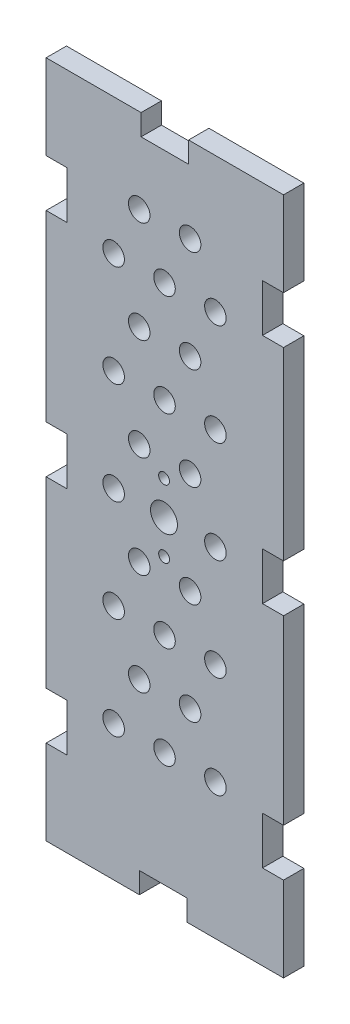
ISO-10303-21;
HEADER;
FILE_DESCRIPTION(('STEP AP214'),'2;1');
FILE_NAME('part.step','',(''),(''),'','','');
FILE_SCHEMA(('AUTOMOTIVE_DESIGN { 1 0 10303 214 1 1 1 1 }'));
ENDSEC;
DATA;
#1=APPLICATION_CONTEXT('core data for automotive mechanical design processes');
#2=APPLICATION_PROTOCOL_DEFINITION('international standard','automotive_design',2000,#1);
#3=PRODUCT_CONTEXT('',#1,'mechanical');
#4=PRODUCT('Part','Part','',(#3));
#5=PRODUCT_RELATED_PRODUCT_CATEGORY('part','',(#4));
#6=PRODUCT_DEFINITION_FORMATION('','',#4);
#7=PRODUCT_DEFINITION_CONTEXT('part definition',#1,'design');
#8=PRODUCT_DEFINITION('design','',#6,#7);
#9=PRODUCT_DEFINITION_SHAPE('','',#8);
#10=(LENGTH_UNIT() NAMED_UNIT(*) SI_UNIT(.MILLI.,.METRE.));
#11=(NAMED_UNIT(*) PLANE_ANGLE_UNIT() SI_UNIT($,.RADIAN.));
#12=(NAMED_UNIT(*) SI_UNIT($,.STERADIAN.) SOLID_ANGLE_UNIT());
#13=UNCERTAINTY_MEASURE_WITH_UNIT(LENGTH_MEASURE(1.E-05),#10,'distance_accuracy_value','');
#14=(GEOMETRIC_REPRESENTATION_CONTEXT(3) GLOBAL_UNCERTAINTY_ASSIGNED_CONTEXT((#13)) GLOBAL_UNIT_ASSIGNED_CONTEXT((#10,
#11,#12)) REPRESENTATION_CONTEXT('',''));
#15=CARTESIAN_POINT('',(0.,0.,0.));
#16=DIRECTION('',(0.,0.,1.));
#17=DIRECTION('',(1.,0.,0.));
#18=AXIS2_PLACEMENT_3D('',#15,#16,#17);
#19=CARTESIAN_POINT('',(0.,0.,6.));
#20=DIRECTION('',(1.,0.,0.));
#21=DIRECTION('',(0.,0.,-1.));
#22=AXIS2_PLACEMENT_3D('',#19,#20,#21);
#23=PLANE('',#22);
#24=DIRECTION('',(0.,-1.,0.));
#25=VECTOR('',#24,1.);
#26=CARTESIAN_POINT('',(0.,0.,6.));
#27=LINE('',#26,#25);
#28=CARTESIAN_POINT('',(0.,25.,6.));
#29=VERTEX_POINT('',#28);
#30=CARTESIAN_POINT('',(0.,0.,6.));
#31=VERTEX_POINT('',#30);
#32=EDGE_CURVE('E496',#29,#31,#27,.T.);
#33=ORIENTED_EDGE('',*,*,#32,.F.);
#34=DIRECTION('',(0.,0.,1.));
#35=VECTOR('',#34,1.);
#36=CARTESIAN_POINT('',(0.,25.,0.));
#37=LINE('',#36,#35);
#38=CARTESIAN_POINT('',(0.,25.,0.));
#39=VERTEX_POINT('',#38);
#40=EDGE_CURVE('E326',#39,#29,#37,.T.);
#41=ORIENTED_EDGE('',*,*,#40,.F.);
#42=DIRECTION('',(0.,-1.,0.));
#43=VECTOR('',#42,1.);
#44=CARTESIAN_POINT('',(0.,0.,0.));
#45=LINE('',#44,#43);
#46=CARTESIAN_POINT('',(0.,0.,0.));
#47=VERTEX_POINT('',#46);
#48=EDGE_CURVE('E306',#39,#47,#45,.T.);
#49=ORIENTED_EDGE('',*,*,#48,.T.);
#50=DIRECTION('',(0.,0.,-1.));
#51=VECTOR('',#50,1.);
#52=CARTESIAN_POINT('',(0.,0.,6.));
#53=LINE('',#52,#51);
#54=EDGE_CURVE('E11',#31,#47,#53,.T.);
#55=ORIENTED_EDGE('',*,*,#54,.F.);
#56=EDGE_LOOP('',(#33,#41,#49,#55));
#57=FACE_BOUND('',#56,.T.);
#58=ADVANCED_FACE('F38',(#57),#23,.F.);
#59=CARTESIAN_POINT('',(0.,93.,0.));
#60=VERTEX_POINT('',#59);
#61=CARTESIAN_POINT('',(0.,39.,0.));
#62=VERTEX_POINT('',#61);
#63=EDGE_CURVE('E597',#60,#62,#45,.T.);
#64=ORIENTED_EDGE('',*,*,#63,.T.);
#65=DIRECTION('',(0.,0.,1.));
#66=VECTOR('',#65,1.);
#67=CARTESIAN_POINT('',(0.,39.,0.));
#68=LINE('',#67,#66);
#69=CARTESIAN_POINT('',(0.,39.,6.));
#70=VERTEX_POINT('',#69);
#71=EDGE_CURVE('E357',#62,#70,#68,.T.);
#72=ORIENTED_EDGE('',*,*,#71,.T.);
#73=CARTESIAN_POINT('',(0.,93.,6.));
#74=VERTEX_POINT('',#73);
#75=EDGE_CURVE('E569',#74,#70,#27,.T.);
#76=ORIENTED_EDGE('',*,*,#75,.F.);
#77=DIRECTION('',(0.,0.,1.));
#78=VECTOR('',#77,1.);
#79=CARTESIAN_POINT('',(0.,93.,0.));
#80=LINE('',#79,#78);
#81=EDGE_CURVE('E330',#60,#74,#80,.T.);
#82=ORIENTED_EDGE('',*,*,#81,.F.);
#83=EDGE_LOOP('',(#64,#72,#76,#82));
#84=FACE_BOUND('',#83,.T.);
#85=ADVANCED_FACE('F596',(#84),#23,.F.);
#86=CARTESIAN_POINT('',(0.,161.,0.));
#87=VERTEX_POINT('',#86);
#88=CARTESIAN_POINT('',(0.,107.,0.));
#89=VERTEX_POINT('',#88);
#90=EDGE_CURVE('E514',#87,#89,#45,.T.);
#91=ORIENTED_EDGE('',*,*,#90,.T.);
#92=DIRECTION('',(0.,0.,1.));
#93=VECTOR('',#92,1.);
#94=CARTESIAN_POINT('',(0.,107.,0.));
#95=LINE('',#94,#93);
#96=CARTESIAN_POINT('',(0.,107.,6.));
#97=VERTEX_POINT('',#96);
#98=EDGE_CURVE('E333',#89,#97,#95,.T.);
#99=ORIENTED_EDGE('',*,*,#98,.T.);
#100=CARTESIAN_POINT('',(0.,161.,6.));
#101=VERTEX_POINT('',#100);
#102=EDGE_CURVE('E495',#101,#97,#27,.T.);
#103=ORIENTED_EDGE('',*,*,#102,.F.);
#104=DIRECTION('',(0.,0.,1.));
#105=VECTOR('',#104,1.);
#106=CARTESIAN_POINT('',(0.,161.,0.));
#107=LINE('',#106,#105);
#108=EDGE_CURVE('E377',#87,#101,#107,.T.);
#109=ORIENTED_EDGE('',*,*,#108,.F.);
#110=EDGE_LOOP('',(#91,#99,#103,#109));
#111=FACE_BOUND('',#110,.T.);
#112=ADVANCED_FACE('F583',(#111),#23,.F.);
#113=CARTESIAN_POINT('',(0.,0.,6.));
#114=DIRECTION('',(0.,1.,0.));
#115=DIRECTION('',(0.,0.,1.));
#116=AXIS2_PLACEMENT_3D('',#113,#114,#115);
#117=PLANE('',#116);
#118=DIRECTION('',(1.,0.,0.));
#119=VECTOR('',#118,1.);
#120=CARTESIAN_POINT('',(0.,0.,0.));
#121=LINE('',#120,#119);
#122=CARTESIAN_POINT('',(27.5,0.,0.));
#123=VERTEX_POINT('',#122);
#124=EDGE_CURVE('E515',#47,#123,#121,.T.);
#125=ORIENTED_EDGE('',*,*,#124,.T.);
#126=DIRECTION('',(0.,0.,1.));
#127=VECTOR('',#126,1.);
#128=CARTESIAN_POINT('',(27.5,0.,0.));
#129=LINE('',#128,#127);
#130=CARTESIAN_POINT('',(27.5,0.,6.));
#131=VERTEX_POINT('',#130);
#132=EDGE_CURVE('E373',#123,#131,#129,.T.);
#133=ORIENTED_EDGE('',*,*,#132,.T.);
#134=DIRECTION('',(1.,0.,0.));
#135=VECTOR('',#134,1.);
#136=CARTESIAN_POINT('',(0.,0.,6.));
#137=LINE('',#136,#135);
#138=EDGE_CURVE('E497',#31,#131,#137,.T.);
#139=ORIENTED_EDGE('',*,*,#138,.F.);
#140=ORIENTED_EDGE('',*,*,#54,.T.);
#141=EDGE_LOOP('',(#125,#133,#139,#140));
#142=FACE_BOUND('',#141,.T.);
#143=ADVANCED_FACE('F562',(#142),#117,.F.);
#144=CARTESIAN_POINT('',(70.,0.,6.));
#145=DIRECTION('',(-1.,0.,0.));
#146=DIRECTION('',(0.,0.,1.));
#147=AXIS2_PLACEMENT_3D('',#144,#145,#146);
#148=PLANE('',#147);
#149=DIRECTION('',(0.,1.,0.));
#150=VECTOR('',#149,1.);
#151=CARTESIAN_POINT('',(70.,0.,0.));
#152=LINE('',#151,#150);
#153=CARTESIAN_POINT('',(70.,106.5,0.));
#154=VERTEX_POINT('',#153);
#155=CARTESIAN_POINT('',(69.9999999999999,161.,0.));
#156=VERTEX_POINT('',#155);
#157=EDGE_CURVE('E1501',#154,#156,#152,.T.);
#158=ORIENTED_EDGE('',*,*,#157,.T.);
#159=DIRECTION('',(0.,0.,1.));
#160=VECTOR('',#159,1.);
#161=CARTESIAN_POINT('',(69.9999999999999,161.,0.));
#162=LINE('',#161,#160);
#163=CARTESIAN_POINT('',(69.9999999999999,161.,6.));
#164=VERTEX_POINT('',#163);
#165=EDGE_CURVE('E423',#156,#164,#162,.T.);
#166=ORIENTED_EDGE('',*,*,#165,.T.);
#167=DIRECTION('',(0.,1.,0.));
#168=VECTOR('',#167,1.);
#169=CARTESIAN_POINT('',(70.,0.,6.));
#170=LINE('',#169,#168);
#171=CARTESIAN_POINT('',(70.,106.5,6.));
#172=VERTEX_POINT('',#171);
#173=EDGE_CURVE('E1514',#172,#164,#170,.T.);
#174=ORIENTED_EDGE('',*,*,#173,.F.);
#175=DIRECTION('',(0.,0.,1.));
#176=VECTOR('',#175,1.);
#177=CARTESIAN_POINT('',(70.,106.5,0.));
#178=LINE('',#177,#176);
#179=EDGE_CURVE('E461',#154,#172,#178,.T.);
#180=ORIENTED_EDGE('',*,*,#179,.F.);
#181=EDGE_LOOP('',(#158,#166,#174,#180));
#182=FACE_BOUND('',#181,.T.);
#183=ADVANCED_FACE('F624',(#182),#148,.F.);
#184=CARTESIAN_POINT('',(69.9999999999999,39.,0.));
#185=VERTEX_POINT('',#184);
#186=CARTESIAN_POINT('',(70.,92.5,0.));
#187=VERTEX_POINT('',#186);
#188=EDGE_CURVE('E522',#185,#187,#152,.T.);
#189=ORIENTED_EDGE('',*,*,#188,.T.);
#190=DIRECTION('',(0.,0.,1.));
#191=VECTOR('',#190,1.);
#192=CARTESIAN_POINT('',(70.,92.5,0.));
#193=LINE('',#192,#191);
#194=CARTESIAN_POINT('',(70.,92.5,6.));
#195=VERTEX_POINT('',#194);
#196=EDGE_CURVE('E449',#187,#195,#193,.T.);
#197=ORIENTED_EDGE('',*,*,#196,.T.);
#198=CARTESIAN_POINT('',(69.9999999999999,39.,6.));
#199=VERTEX_POINT('',#198);
#200=EDGE_CURVE('E505',#199,#195,#170,.T.);
#201=ORIENTED_EDGE('',*,*,#200,.F.);
#202=DIRECTION('',(0.,0.,1.));
#203=VECTOR('',#202,1.);
#204=CARTESIAN_POINT('',(69.9999999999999,39.,0.));
#205=LINE('',#204,#203);
#206=EDGE_CURVE('E487',#185,#199,#205,.T.);
#207=ORIENTED_EDGE('',*,*,#206,.F.);
#208=EDGE_LOOP('',(#189,#197,#201,#207));
#209=FACE_BOUND('',#208,.T.);
#210=ADVANCED_FACE('F628',(#209),#148,.F.);
#211=CARTESIAN_POINT('',(70.,0.,0.));
#212=VERTEX_POINT('',#211);
#213=CARTESIAN_POINT('',(70.,25.,0.));
#214=VERTEX_POINT('',#213);
#215=EDGE_CURVE('E519',#212,#214,#152,.T.);
#216=ORIENTED_EDGE('',*,*,#215,.T.);
#217=DIRECTION('',(0.,0.,1.));
#218=VECTOR('',#217,1.);
#219=CARTESIAN_POINT('',(70.,25.,0.));
#220=LINE('',#219,#218);
#221=CARTESIAN_POINT('',(70.,25.,6.));
#222=VERTEX_POINT('',#221);
#223=EDGE_CURVE('E475',#214,#222,#220,.T.);
#224=ORIENTED_EDGE('',*,*,#223,.T.);
#225=CARTESIAN_POINT('',(70.,0.,6.));
#226=VERTEX_POINT('',#225);
#227=EDGE_CURVE('E501',#226,#222,#170,.T.);
#228=ORIENTED_EDGE('',*,*,#227,.F.);
#229=DIRECTION('',(0.,0.,-1.));
#230=VECTOR('',#229,1.);
#231=CARTESIAN_POINT('',(70.,0.,6.));
#232=LINE('',#231,#230);
#233=EDGE_CURVE('E46',#226,#212,#232,.T.);
#234=ORIENTED_EDGE('',*,*,#233,.T.);
#235=EDGE_LOOP('',(#216,#224,#228,#234));
#236=FACE_BOUND('',#235,.T.);
#237=ADVANCED_FACE('F535',(#236),#148,.F.);
#238=CARTESIAN_POINT('',(0.,200.,6.));
#239=DIRECTION('',(0.,-1.,0.));
#240=DIRECTION('',(0.,0.,-1.));
#241=AXIS2_PLACEMENT_3D('',#238,#239,#240);
#242=PLANE('',#241);
#243=DIRECTION('',(-1.,0.,0.));
#244=VECTOR('',#243,1.);
#245=CARTESIAN_POINT('',(0.,200.,6.));
#246=LINE('',#245,#244);
#247=CARTESIAN_POINT('',(28.,200.,6.));
#248=VERTEX_POINT('',#247);
#249=CARTESIAN_POINT('',(0.,200.,6.));
#250=VERTEX_POINT('',#249);
#251=EDGE_CURVE('E504',#248,#250,#246,.T.);
#252=ORIENTED_EDGE('',*,*,#251,.F.);
#253=DIRECTION('',(0.,0.,1.));
#254=VECTOR('',#253,1.);
#255=CARTESIAN_POINT('',(28.,200.,0.));
#256=LINE('',#255,#254);
#257=CARTESIAN_POINT('',(28.,200.,0.));
#258=VERTEX_POINT('',#257);
#259=EDGE_CURVE('E304',#258,#248,#256,.T.);
#260=ORIENTED_EDGE('',*,*,#259,.F.);
#261=DIRECTION('',(-1.,0.,0.));
#262=VECTOR('',#261,1.);
#263=CARTESIAN_POINT('',(0.,200.,0.));
#264=LINE('',#263,#262);
#265=CARTESIAN_POINT('',(0.,200.,0.));
#266=VERTEX_POINT('',#265);
#267=EDGE_CURVE('E291',#258,#266,#264,.T.);
#268=ORIENTED_EDGE('',*,*,#267,.T.);
#269=DIRECTION('',(0.,0.,-1.));
#270=VECTOR('',#269,1.);
#271=CARTESIAN_POINT('',(0.,200.,6.));
#272=LINE('',#271,#270);
#273=EDGE_CURVE('E509',#250,#266,#272,.T.);
#274=ORIENTED_EDGE('',*,*,#273,.F.);
#275=EDGE_LOOP('',(#252,#260,#268,#274));
#276=FACE_BOUND('',#275,.T.);
#277=ADVANCED_FACE('F610',(#276),#242,.F.);
#278=CARTESIAN_POINT('',(0.,175.,0.));
#279=VERTEX_POINT('',#278);
#280=EDGE_CURVE('E510',#266,#279,#45,.T.);
#281=ORIENTED_EDGE('',*,*,#280,.T.);
#282=DIRECTION('',(0.,0.,1.));
#283=VECTOR('',#282,1.);
#284=CARTESIAN_POINT('',(0.,175.,0.));
#285=LINE('',#284,#283);
#286=CARTESIAN_POINT('',(0.,175.,6.));
#287=VERTEX_POINT('',#286);
#288=EDGE_CURVE('E407',#279,#287,#285,.T.);
#289=ORIENTED_EDGE('',*,*,#288,.T.);
#290=EDGE_CURVE('E491',#250,#287,#27,.T.);
#291=ORIENTED_EDGE('',*,*,#290,.F.);
#292=ORIENTED_EDGE('',*,*,#273,.T.);
#293=EDGE_LOOP('',(#281,#289,#291,#292));
#294=FACE_BOUND('',#293,.T.);
#295=ADVANCED_FACE('F40',(#294),#23,.F.);
#296=CARTESIAN_POINT('',(41.5,0.,6.));
#297=VERTEX_POINT('',#296);
#298=EDGE_CURVE('E494',#297,#226,#137,.T.);
#299=ORIENTED_EDGE('',*,*,#298,.F.);
#300=DIRECTION('',(0.,0.,1.));
#301=VECTOR('',#300,1.);
#302=CARTESIAN_POINT('',(41.5,0.,0.));
#303=LINE('',#302,#301);
#304=CARTESIAN_POINT('',(41.5,0.,0.));
#305=VERTEX_POINT('',#304);
#306=EDGE_CURVE('E385',#305,#297,#303,.T.);
#307=ORIENTED_EDGE('',*,*,#306,.F.);
#308=EDGE_CURVE('E513',#305,#212,#121,.T.);
#309=ORIENTED_EDGE('',*,*,#308,.T.);
#310=ORIENTED_EDGE('',*,*,#233,.F.);
#311=EDGE_LOOP('',(#299,#307,#309,#310));
#312=FACE_BOUND('',#311,.T.);
#313=ADVANCED_FACE('F549',(#312),#117,.F.);
#314=CARTESIAN_POINT('',(69.9999999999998,175.,6.));
#315=VERTEX_POINT('',#314);
#316=CARTESIAN_POINT('',(70.,200.,6.));
#317=VERTEX_POINT('',#316);
#318=EDGE_CURVE('E500',#315,#317,#170,.T.);
#319=ORIENTED_EDGE('',*,*,#318,.F.);
#320=DIRECTION('',(0.,0.,1.));
#321=VECTOR('',#320,1.);
#322=CARTESIAN_POINT('',(69.9999999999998,175.,0.));
#323=LINE('',#322,#321);
#324=CARTESIAN_POINT('',(69.9999999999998,175.,0.));
#325=VERTEX_POINT('',#324);
#326=EDGE_CURVE('E435',#325,#315,#323,.T.);
#327=ORIENTED_EDGE('',*,*,#326,.F.);
#328=CARTESIAN_POINT('',(70.,200.,0.));
#329=VERTEX_POINT('',#328);
#330=EDGE_CURVE('E518',#325,#329,#152,.T.);
#331=ORIENTED_EDGE('',*,*,#330,.T.);
#332=DIRECTION('',(0.,0.,-1.));
#333=VECTOR('',#332,1.);
#334=CARTESIAN_POINT('',(70.,200.,6.));
#335=LINE('',#334,#333);
#336=EDGE_CURVE('E528',#317,#329,#335,.T.);
#337=ORIENTED_EDGE('',*,*,#336,.F.);
#338=EDGE_LOOP('',(#319,#327,#331,#337));
#339=FACE_BOUND('',#338,.T.);
#340=ADVANCED_FACE('F616',(#339),#148,.F.);
#341=CARTESIAN_POINT('',(42.,200.,0.));
#342=VERTEX_POINT('',#341);
#343=EDGE_CURVE('E523',#329,#342,#264,.T.);
#344=ORIENTED_EDGE('',*,*,#343,.T.);
#345=DIRECTION('',(0.,0.,1.));
#346=VECTOR('',#345,1.);
#347=CARTESIAN_POINT('',(42.,200.,0.));
#348=LINE('',#347,#346);
#349=CARTESIAN_POINT('',(42.,200.,6.));
#350=VERTEX_POINT('',#349);
#351=EDGE_CURVE('E307',#342,#350,#348,.T.);
#352=ORIENTED_EDGE('',*,*,#351,.T.);
#353=EDGE_CURVE('E506',#317,#350,#246,.T.);
#354=ORIENTED_EDGE('',*,*,#353,.F.);
#355=ORIENTED_EDGE('',*,*,#336,.T.);
#356=EDGE_LOOP('',(#344,#352,#354,#355));
#357=FACE_BOUND('',#356,.T.);
#358=ADVANCED_FACE('F619',(#357),#242,.F.);
#359=CARTESIAN_POINT('',(0.,0.,6.));
#360=DIRECTION('',(0.,0.,-1.));
#361=DIRECTION('',(-1.,0.,0.));
#362=AXIS2_PLACEMENT_3D('',#359,#360,#361);
#363=PLANE('',#362);
#364=CARTESIAN_POINT('',(42.4498933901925,115.,6.));
#365=DIRECTION('',(0.,0.,1.));
#366=DIRECTION('',(1.,0.,0.));
#367=AXIS2_PLACEMENT_3D('',#364,#365,#366);
#368=CIRCLE('',#367,3.175);
#369=CARTESIAN_POINT('',(45.6248933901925,115.,6.));
#370=VERTEX_POINT('',#369);
#371=EDGE_CURVE('E892',#370,#370,#368,.T.);
#372=ORIENTED_EDGE('',*,*,#371,.F.);
#373=EDGE_LOOP('',(#372));
#374=FACE_BOUND('',#373,.T.);
#375=CARTESIAN_POINT('',(34.75,100.,6.));
#376=DIRECTION('',(0.,0.,1.));
#377=DIRECTION('',(1.,0.,0.));
#378=AXIS2_PLACEMENT_3D('',#375,#376,#377);
#379=CIRCLE('',#378,3.975);
#380=CARTESIAN_POINT('',(38.725,100.,6.));
#381=VERTEX_POINT('',#380);
#382=EDGE_CURVE('E917',#381,#381,#379,.T.);
#383=ORIENTED_EDGE('',*,*,#382,.F.);
#384=EDGE_LOOP('',(#383));
#385=FACE_BOUND('',#384,.T.);
#386=CARTESIAN_POINT('',(19.9099147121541,100.,6.));
#387=DIRECTION('',(0.,0.,1.));
#388=DIRECTION('',(1.,0.,0.));
#389=AXIS2_PLACEMENT_3D('',#386,#387,#388);
#390=CIRCLE('',#389,3.175);
#391=CARTESIAN_POINT('',(23.0849147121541,100.,6.));
#392=VERTEX_POINT('',#391);
#393=EDGE_CURVE('E916',#392,#392,#390,.T.);
#394=ORIENTED_EDGE('',*,*,#393,.F.);
#395=EDGE_LOOP('',(#394));
#396=FACE_BOUND('',#395,.T.);
#397=CARTESIAN_POINT('',(49.9099147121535,160.,6.));
#398=DIRECTION('',(0.,0.,1.));
#399=DIRECTION('',(1.,0.,0.));
#400=AXIS2_PLACEMENT_3D('',#397,#398,#399);
#401=CIRCLE('',#400,3.175);
#402=CARTESIAN_POINT('',(53.0849147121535,160.,6.));
#403=VERTEX_POINT('',#402);
#404=EDGE_CURVE('E929',#403,#403,#401,.T.);
#405=ORIENTED_EDGE('',*,*,#404,.F.);
#406=EDGE_LOOP('',(#405));
#407=FACE_BOUND('',#406,.T.);
#408=CARTESIAN_POINT('',(27.4498933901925,115.,6.));
#409=DIRECTION('',(0.,0.,1.));
#410=DIRECTION('',(1.,0.,0.));
#411=AXIS2_PLACEMENT_3D('',#408,#409,#410);
#412=CIRCLE('',#411,3.175);
#413=CARTESIAN_POINT('',(30.6248933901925,115.,6.));
#414=VERTEX_POINT('',#413);
#415=EDGE_CURVE('E893',#414,#414,#412,.T.);
#416=ORIENTED_EDGE('',*,*,#415,.F.);
#417=EDGE_LOOP('',(#416));
#418=FACE_BOUND('',#417,.T.);
#419=CARTESIAN_POINT('',(49.9099147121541,100.,6.));
#420=DIRECTION('',(0.,0.,1.));
#421=DIRECTION('',(1.,0.,0.));
#422=AXIS2_PLACEMENT_3D('',#419,#420,#421);
#423=CIRCLE('',#422,3.175);
#424=CARTESIAN_POINT('',(53.0849147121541,100.,6.));
#425=VERTEX_POINT('',#424);
#426=EDGE_CURVE('E899',#425,#425,#423,.T.);
#427=ORIENTED_EDGE('',*,*,#426,.F.);
#428=EDGE_LOOP('',(#427));
#429=FACE_BOUND('',#428,.T.);
#430=CARTESIAN_POINT('',(19.9099147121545,70.,6.));
#431=DIRECTION('',(0.,0.,1.));
#432=DIRECTION('',(1.,0.,0.));
#433=AXIS2_PLACEMENT_3D('',#430,#431,#432);
#434=CIRCLE('',#433,3.175);
#435=CARTESIAN_POINT('',(23.0849147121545,70.,6.));
#436=VERTEX_POINT('',#435);
#437=EDGE_CURVE('E905',#436,#436,#434,.T.);
#438=ORIENTED_EDGE('',*,*,#437,.F.);
#439=EDGE_LOOP('',(#438));
#440=FACE_BOUND('',#439,.T.);
#441=CARTESIAN_POINT('',(34.9099147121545,70.,6.));
#442=DIRECTION('',(0.,0.,1.));
#443=DIRECTION('',(1.,0.,0.));
#444=AXIS2_PLACEMENT_3D('',#441,#442,#443);
#445=CIRCLE('',#444,3.175);
#446=CARTESIAN_POINT('',(38.0849147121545,70.,6.));
#447=VERTEX_POINT('',#446);
#448=EDGE_CURVE('E857',#447,#447,#445,.T.);
#449=ORIENTED_EDGE('',*,*,#448,.F.);
#450=EDGE_LOOP('',(#449));
#451=FACE_BOUND('',#450,.T.);
#452=CARTESIAN_POINT('',(34.9099147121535,160.,6.));
#453=DIRECTION('',(0.,0.,1.));
#454=DIRECTION('',(1.,0.,0.));
#455=AXIS2_PLACEMENT_3D('',#452,#453,#454);
#456=CIRCLE('',#455,3.175);
#457=CARTESIAN_POINT('',(38.0849147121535,160.,6.));
#458=VERTEX_POINT('',#457);
#459=EDGE_CURVE('E964',#458,#458,#456,.T.);
#460=ORIENTED_EDGE('',*,*,#459,.F.);
#461=EDGE_LOOP('',(#460));
#462=FACE_BOUND('',#461,.T.);
#463=CARTESIAN_POINT('',(42.4498933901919,175.,6.));
#464=DIRECTION('',(0.,0.,1.));
#465=DIRECTION('',(1.,0.,0.));
#466=AXIS2_PLACEMENT_3D('',#463,#464,#465);
#467=CIRCLE('',#466,3.175);
#468=CARTESIAN_POINT('',(45.6248933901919,175.,6.));
#469=VERTEX_POINT('',#468);
#470=EDGE_CURVE('E970',#469,#469,#467,.T.);
#471=ORIENTED_EDGE('',*,*,#470,.F.);
#472=EDGE_LOOP('',(#471));
#473=FACE_BOUND('',#472,.T.);
#474=CARTESIAN_POINT('',(19.9099147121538,130.,6.));
#475=DIRECTION('',(0.,0.,1.));
#476=DIRECTION('',(1.,0.,0.));
#477=AXIS2_PLACEMENT_3D('',#474,#475,#476);
#478=CIRCLE('',#477,3.175);
#479=CARTESIAN_POINT('',(23.0849147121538,130.,6.));
#480=VERTEX_POINT('',#479);
#481=EDGE_CURVE('E976',#480,#480,#478,.T.);
#482=ORIENTED_EDGE('',*,*,#481,.F.);
#483=EDGE_LOOP('',(#482));
#484=FACE_BOUND('',#483,.T.);
#485=CARTESIAN_POINT('',(34.9099147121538,130.,6.));
#486=DIRECTION('',(0.,0.,1.));
#487=DIRECTION('',(1.,0.,0.));
#488=AXIS2_PLACEMENT_3D('',#485,#486,#487);
#489=CIRCLE('',#488,3.175);
#490=CARTESIAN_POINT('',(38.0849147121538,130.,6.));
#491=VERTEX_POINT('',#490);
#492=EDGE_CURVE('E952',#491,#491,#489,.T.);
#493=ORIENTED_EDGE('',*,*,#492,.F.);
#494=EDGE_LOOP('',(#493));
#495=FACE_BOUND('',#494,.T.);
#496=CARTESIAN_POINT('',(49.9099147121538,130.,6.));
#497=DIRECTION('',(0.,0.,1.));
#498=DIRECTION('',(1.,0.,0.));
#499=AXIS2_PLACEMENT_3D('',#496,#497,#498);
#500=CIRCLE('',#499,3.175);
#501=CARTESIAN_POINT('',(53.0849147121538,130.,6.));
#502=VERTEX_POINT('',#501);
#503=EDGE_CURVE('E928',#502,#502,#500,.T.);
#504=ORIENTED_EDGE('',*,*,#503,.F.);
#505=EDGE_LOOP('',(#504));
#506=FACE_BOUND('',#505,.T.);
#507=CARTESIAN_POINT('',(27.4498933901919,175.,6.));
#508=DIRECTION('',(0.,0.,1.));
#509=DIRECTION('',(1.,0.,0.));
#510=AXIS2_PLACEMENT_3D('',#507,#508,#509);
#511=CIRCLE('',#510,3.175);
#512=CARTESIAN_POINT('',(30.6248933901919,175.,6.));
#513=VERTEX_POINT('',#512);
#514=EDGE_CURVE('E941',#513,#513,#511,.T.);
#515=ORIENTED_EDGE('',*,*,#514,.F.);
#516=EDGE_LOOP('',(#515));
#517=FACE_BOUND('',#516,.T.);
#518=CARTESIAN_POINT('',(27.4498933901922,145.,6.));
#519=DIRECTION('',(0.,0.,1.));
#520=DIRECTION('',(1.,0.,0.));
#521=AXIS2_PLACEMENT_3D('',#518,#519,#520);
#522=CIRCLE('',#521,3.175);
#523=CARTESIAN_POINT('',(30.6248933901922,145.,6.));
#524=VERTEX_POINT('',#523);
#525=EDGE_CURVE('E940',#524,#524,#522,.T.);
#526=ORIENTED_EDGE('',*,*,#525,.F.);
#527=EDGE_LOOP('',(#526));
#528=FACE_BOUND('',#527,.T.);
#529=CARTESIAN_POINT('',(42.4498933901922,145.,6.));
#530=DIRECTION('',(0.,0.,1.));
#531=DIRECTION('',(1.,0.,0.));
#532=AXIS2_PLACEMENT_3D('',#529,#530,#531);
#533=CIRCLE('',#532,3.175);
#534=CARTESIAN_POINT('',(45.6248933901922,145.,6.));
#535=VERTEX_POINT('',#534);
#536=EDGE_CURVE('E953',#535,#535,#533,.T.);
#537=ORIENTED_EDGE('',*,*,#536,.F.);
#538=EDGE_LOOP('',(#537));
#539=FACE_BOUND('',#538,.T.);
#540=CARTESIAN_POINT('',(34.9099147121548,40.,6.));
#541=DIRECTION('',(0.,0.,1.));
#542=DIRECTION('',(1.,0.,0.));
#543=AXIS2_PLACEMENT_3D('',#540,#541,#542);
#544=CIRCLE('',#543,3.175);
#545=CARTESIAN_POINT('',(38.0849147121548,40.,6.));
#546=VERTEX_POINT('',#545);
#547=EDGE_CURVE('E846',#546,#546,#544,.T.);
#548=ORIENTED_EDGE('',*,*,#547,.F.);
#549=EDGE_LOOP('',(#548));
#550=FACE_BOUND('',#549,.T.);
#551=CARTESIAN_POINT('',(42.4498933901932,55.,6.));
#552=DIRECTION('',(0.,0.,1.));
#553=DIRECTION('',(1.,0.,0.));
#554=AXIS2_PLACEMENT_3D('',#551,#552,#553);
#555=CIRCLE('',#554,3.175);
#556=CARTESIAN_POINT('',(45.6248933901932,55.,6.));
#557=VERTEX_POINT('',#556);
#558=EDGE_CURVE('E833',#557,#557,#555,.T.);
#559=ORIENTED_EDGE('',*,*,#558,.F.);
#560=EDGE_LOOP('',(#559));
#561=FACE_BOUND('',#560,.T.);
#562=CARTESIAN_POINT('',(27.4498933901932,55.,6.));
#563=DIRECTION('',(0.,0.,1.));
#564=DIRECTION('',(1.,0.,0.));
#565=AXIS2_PLACEMENT_3D('',#562,#563,#564);
#566=CIRCLE('',#565,3.175);
#567=CARTESIAN_POINT('',(30.6248933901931,55.,6.));
#568=VERTEX_POINT('',#567);
#569=EDGE_CURVE('E829',#568,#568,#566,.T.);
#570=ORIENTED_EDGE('',*,*,#569,.F.);
#571=EDGE_LOOP('',(#570));
#572=FACE_BOUND('',#571,.T.);
#573=CARTESIAN_POINT('',(49.9099147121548,40.,6.));
#574=DIRECTION('',(0.,0.,1.));
#575=DIRECTION('',(1.,0.,0.));
#576=AXIS2_PLACEMENT_3D('',#573,#574,#575);
#577=CIRCLE('',#576,3.175);
#578=CARTESIAN_POINT('',(53.0849147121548,40.,6.));
#579=VERTEX_POINT('',#578);
#580=EDGE_CURVE('E836',#579,#579,#577,.T.);
#581=ORIENTED_EDGE('',*,*,#580,.F.);
#582=EDGE_LOOP('',(#581));
#583=FACE_BOUND('',#582,.T.);
#584=CARTESIAN_POINT('',(19.9099147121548,40.,6.));
#585=DIRECTION('',(0.,0.,1.));
#586=DIRECTION('',(1.,0.,0.));
#587=AXIS2_PLACEMENT_3D('',#584,#585,#586);
#588=CIRCLE('',#587,3.175);
#589=CARTESIAN_POINT('',(23.0849147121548,40.,6.));
#590=VERTEX_POINT('',#589);
#591=EDGE_CURVE('E845',#590,#590,#588,.T.);
#592=ORIENTED_EDGE('',*,*,#591,.F.);
#593=EDGE_LOOP('',(#592));
#594=FACE_BOUND('',#593,.T.);
#595=CARTESIAN_POINT('',(49.9099147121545,70.,6.));
#596=DIRECTION('',(0.,0.,1.));
#597=DIRECTION('',(1.,0.,0.));
#598=AXIS2_PLACEMENT_3D('',#595,#596,#597);
#599=CIRCLE('',#598,3.175);
#600=CARTESIAN_POINT('',(53.0849147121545,70.,6.));
#601=VERTEX_POINT('',#600);
#602=EDGE_CURVE('E870',#601,#601,#599,.T.);
#603=ORIENTED_EDGE('',*,*,#602,.F.);
#604=EDGE_LOOP('',(#603));
#605=FACE_BOUND('',#604,.T.);
#606=CARTESIAN_POINT('',(27.4498933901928,85.,6.));
#607=DIRECTION('',(0.,0.,1.));
#608=DIRECTION('',(1.,0.,0.));
#609=AXIS2_PLACEMENT_3D('',#606,#607,#608);
#610=CIRCLE('',#609,3.175);
#611=CARTESIAN_POINT('',(30.6248933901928,85.,6.));
#612=VERTEX_POINT('',#611);
#613=EDGE_CURVE('E864',#612,#612,#610,.T.);
#614=ORIENTED_EDGE('',*,*,#613,.F.);
#615=EDGE_LOOP('',(#614));
#616=FACE_BOUND('',#615,.T.);
#617=CARTESIAN_POINT('',(42.4498933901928,85.,6.));
#618=DIRECTION('',(0.,0.,1.));
#619=DIRECTION('',(1.,0.,0.));
#620=AXIS2_PLACEMENT_3D('',#617,#618,#619);
#621=CIRCLE('',#620,3.175);
#622=CARTESIAN_POINT('',(45.6248933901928,85.,6.));
#623=VERTEX_POINT('',#622);
#624=EDGE_CURVE('E858',#623,#623,#621,.T.);
#625=ORIENTED_EDGE('',*,*,#624,.F.);
#626=EDGE_LOOP('',(#625));
#627=FACE_BOUND('',#626,.T.);
#628=CARTESIAN_POINT('',(34.7766524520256,110.,6.));
#629=DIRECTION('',(0.,0.,1.));
#630=DIRECTION('',(1.,0.,0.));
#631=AXIS2_PLACEMENT_3D('',#628,#629,#630);
#632=CIRCLE('',#631,1.6);
#633=CARTESIAN_POINT('',(36.3766524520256,110.,6.));
#634=VERTEX_POINT('',#633);
#635=EDGE_CURVE('E880',#634,#634,#632,.T.);
#636=ORIENTED_EDGE('',*,*,#635,.F.);
#637=EDGE_LOOP('',(#636));
#638=FACE_BOUND('',#637,.T.);
#639=CARTESIAN_POINT('',(34.7766524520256,90.,6.));
#640=DIRECTION('',(0.,0.,1.));
#641=DIRECTION('',(-1.,0.,0.));
#642=AXIS2_PLACEMENT_3D('',#639,#640,#641);
#643=CIRCLE('',#642,1.6);
#644=CARTESIAN_POINT('',(33.1766524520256,90.,6.));
#645=VERTEX_POINT('',#644);
#646=EDGE_CURVE('E886',#645,#645,#643,.T.);
#647=ORIENTED_EDGE('',*,*,#646,.F.);
#648=EDGE_LOOP('',(#647));
#649=FACE_BOUND('',#648,.T.);
#650=CARTESIAN_POINT('',(19.9099147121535,160.,6.));
#651=DIRECTION('',(0.,0.,1.));
#652=DIRECTION('',(1.,0.,0.));
#653=AXIS2_PLACEMENT_3D('',#650,#651,#652);
#654=CIRCLE('',#653,3.175);
#655=CARTESIAN_POINT('',(23.0849147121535,160.,6.));
#656=VERTEX_POINT('',#655);
#657=EDGE_CURVE('E297',#656,#656,#654,.T.);
#658=ORIENTED_EDGE('',*,*,#657,.F.);
#659=EDGE_LOOP('',(#658));
#660=FACE_BOUND('',#659,.T.);
#661=DIRECTION('',(1.,0.,0.));
#662=VECTOR('',#661,1.);
#663=CARTESIAN_POINT('',(28.,193.8,6.));
#664=LINE('',#663,#662);
#665=CARTESIAN_POINT('',(28.,193.8,6.));
#666=VERTEX_POINT('',#665);
#667=CARTESIAN_POINT('',(42.,193.8,6.));
#668=VERTEX_POINT('',#667);
#669=EDGE_CURVE('E294',#666,#668,#664,.T.);
#670=ORIENTED_EDGE('',*,*,#669,.F.);
#671=DIRECTION('',(0.,-1.,0.));
#672=VECTOR('',#671,1.);
#673=CARTESIAN_POINT('',(28.,200.,6.));
#674=LINE('',#673,#672);
#675=EDGE_CURVE('E277',#248,#666,#674,.T.);
#676=ORIENTED_EDGE('',*,*,#675,.F.);
#677=ORIENTED_EDGE('',*,*,#251,.T.);
#678=ORIENTED_EDGE('',*,*,#290,.T.);
#679=DIRECTION('',(-1.,0.,0.));
#680=VECTOR('',#679,1.);
#681=CARTESIAN_POINT('',(6.2,175.,6.));
#682=LINE('',#681,#680);
#683=CARTESIAN_POINT('',(6.2,175.,6.));
#684=VERTEX_POINT('',#683);
#685=EDGE_CURVE('E393',#684,#287,#682,.T.);
#686=ORIENTED_EDGE('',*,*,#685,.F.);
#687=DIRECTION('',(0.,1.,0.));
#688=VECTOR('',#687,1.);
#689=CARTESIAN_POINT('',(6.20000000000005,161.,6.));
#690=LINE('',#689,#688);
#691=CARTESIAN_POINT('',(6.20000000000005,161.,6.));
#692=VERTEX_POINT('',#691);
#693=EDGE_CURVE('E402',#692,#684,#690,.T.);
#694=ORIENTED_EDGE('',*,*,#693,.F.);
#695=DIRECTION('',(1.,0.,0.));
#696=VECTOR('',#695,1.);
#697=CARTESIAN_POINT('',(0.,161.,6.));
#698=LINE('',#697,#696);
#699=EDGE_CURVE('E332',#101,#692,#698,.T.);
#700=ORIENTED_EDGE('',*,*,#699,.F.);
#701=ORIENTED_EDGE('',*,*,#102,.T.);
#702=DIRECTION('',(-1.,0.,0.));
#703=VECTOR('',#702,1.);
#704=CARTESIAN_POINT('',(6.2,107.,6.));
#705=LINE('',#704,#703);
#706=CARTESIAN_POINT('',(6.2,107.,6.));
#707=VERTEX_POINT('',#706);
#708=EDGE_CURVE('E315',#707,#97,#705,.T.);
#709=ORIENTED_EDGE('',*,*,#708,.F.);
#710=DIRECTION('',(0.,1.,0.));
#711=VECTOR('',#710,1.);
#712=CARTESIAN_POINT('',(6.20000000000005,93.,6.));
#713=LINE('',#712,#711);
#714=CARTESIAN_POINT('',(6.20000000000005,93.,6.));
#715=VERTEX_POINT('',#714);
#716=EDGE_CURVE('E325',#715,#707,#713,.T.);
#717=ORIENTED_EDGE('',*,*,#716,.F.);
#718=DIRECTION('',(1.,0.,0.));
#719=VECTOR('',#718,1.);
#720=CARTESIAN_POINT('',(0.,93.,6.));
#721=LINE('',#720,#719);
#722=EDGE_CURVE('E322',#74,#715,#721,.T.);
#723=ORIENTED_EDGE('',*,*,#722,.F.);
#724=ORIENTED_EDGE('',*,*,#75,.T.);
#725=DIRECTION('',(-1.,0.,0.));
#726=VECTOR('',#725,1.);
#727=CARTESIAN_POINT('',(6.2,39.,6.));
#728=LINE('',#727,#726);
#729=CARTESIAN_POINT('',(6.2,39.,6.));
#730=VERTEX_POINT('',#729);
#731=EDGE_CURVE('E343',#730,#70,#728,.T.);
#732=ORIENTED_EDGE('',*,*,#731,.F.);
#733=DIRECTION('',(0.,1.,0.));
#734=VECTOR('',#733,1.);
#735=CARTESIAN_POINT('',(6.20000000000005,25.,6.));
#736=LINE('',#735,#734);
#737=CARTESIAN_POINT('',(6.20000000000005,25.,6.));
#738=VERTEX_POINT('',#737);
#739=EDGE_CURVE('E351',#738,#730,#736,.T.);
#740=ORIENTED_EDGE('',*,*,#739,.F.);
#741=DIRECTION('',(1.,0.,0.));
#742=VECTOR('',#741,1.);
#743=CARTESIAN_POINT('',(0.,25.,6.));
#744=LINE('',#743,#742);
#745=EDGE_CURVE('E348',#29,#738,#744,.T.);
#746=ORIENTED_EDGE('',*,*,#745,.F.);
#747=ORIENTED_EDGE('',*,*,#32,.T.);
#748=ORIENTED_EDGE('',*,*,#138,.T.);
#749=DIRECTION('',(0.,-1.,0.));
#750=VECTOR('',#749,1.);
#751=CARTESIAN_POINT('',(27.5,6.2,6.));
#752=LINE('',#751,#750);
#753=CARTESIAN_POINT('',(27.5,6.2,6.));
#754=VERTEX_POINT('',#753);
#755=EDGE_CURVE('E374',#754,#131,#752,.T.);
#756=ORIENTED_EDGE('',*,*,#755,.F.);
#757=DIRECTION('',(-1.,0.,0.));
#758=VECTOR('',#757,1.);
#759=CARTESIAN_POINT('',(41.5,6.2,6.));
#760=LINE('',#759,#758);
#761=CARTESIAN_POINT('',(41.5,6.2,6.));
#762=VERTEX_POINT('',#761);
#763=EDGE_CURVE('E367',#762,#754,#760,.T.);
#764=ORIENTED_EDGE('',*,*,#763,.F.);
#765=DIRECTION('',(0.,1.,0.));
#766=VECTOR('',#765,1.);
#767=CARTESIAN_POINT('',(41.5,0.,6.));
#768=LINE('',#767,#766);
#769=EDGE_CURVE('E376',#297,#762,#768,.T.);
#770=ORIENTED_EDGE('',*,*,#769,.F.);
#771=ORIENTED_EDGE('',*,*,#298,.T.);
#772=ORIENTED_EDGE('',*,*,#227,.T.);
#773=DIRECTION('',(1.,0.,0.));
#774=VECTOR('',#773,1.);
#775=CARTESIAN_POINT('',(63.8,25.,6.));
#776=LINE('',#775,#774);
#777=CARTESIAN_POINT('',(63.8,25.,6.));
#778=VERTEX_POINT('',#777);
#779=EDGE_CURVE('E476',#778,#222,#776,.T.);
#780=ORIENTED_EDGE('',*,*,#779,.F.);
#781=DIRECTION('',(0.,-1.,0.));
#782=VECTOR('',#781,1.);
#783=CARTESIAN_POINT('',(63.7999999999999,39.,6.));
#784=LINE('',#783,#782);
#785=CARTESIAN_POINT('',(63.7999999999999,39.,6.));
#786=VERTEX_POINT('',#785);
#787=EDGE_CURVE('E469',#786,#778,#784,.T.);
#788=ORIENTED_EDGE('',*,*,#787,.F.);
#789=DIRECTION('',(-1.,0.,0.));
#790=VECTOR('',#789,1.);
#791=CARTESIAN_POINT('',(69.9999999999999,39.,6.));
#792=LINE('',#791,#790);
#793=EDGE_CURVE('E478',#199,#786,#792,.T.);
#794=ORIENTED_EDGE('',*,*,#793,.F.);
#795=ORIENTED_EDGE('',*,*,#200,.T.);
#796=DIRECTION('',(1.,0.,0.));
#797=VECTOR('',#796,1.);
#798=CARTESIAN_POINT('',(63.8,92.5,6.));
#799=LINE('',#798,#797);
#800=CARTESIAN_POINT('',(63.8,92.5,6.));
#801=VERTEX_POINT('',#800);
#802=EDGE_CURVE('E450',#801,#195,#799,.T.);
#803=ORIENTED_EDGE('',*,*,#802,.F.);
#804=DIRECTION('',(0.,-1.,0.));
#805=VECTOR('',#804,1.);
#806=CARTESIAN_POINT('',(63.8,106.5,6.));
#807=LINE('',#806,#805);
#808=CARTESIAN_POINT('',(63.8,106.5,6.));
#809=VERTEX_POINT('',#808);
#810=EDGE_CURVE('E443',#809,#801,#807,.T.);
#811=ORIENTED_EDGE('',*,*,#810,.F.);
#812=DIRECTION('',(-1.,0.,0.));
#813=VECTOR('',#812,1.);
#814=CARTESIAN_POINT('',(70.,106.5,6.));
#815=LINE('',#814,#813);
#816=EDGE_CURVE('E452',#172,#809,#815,.T.);
#817=ORIENTED_EDGE('',*,*,#816,.F.);
#818=ORIENTED_EDGE('',*,*,#173,.T.);
#819=DIRECTION('',(1.,0.,0.));
#820=VECTOR('',#819,1.);
#821=CARTESIAN_POINT('',(63.7999999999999,161.,6.));
#822=LINE('',#821,#820);
#823=CARTESIAN_POINT('',(63.7999999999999,161.,6.));
#824=VERTEX_POINT('',#823);
#825=EDGE_CURVE('E424',#824,#164,#822,.T.);
#826=ORIENTED_EDGE('',*,*,#825,.F.);
#827=DIRECTION('',(0.,-1.,0.));
#828=VECTOR('',#827,1.);
#829=CARTESIAN_POINT('',(63.7999999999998,175.,6.));
#830=LINE('',#829,#828);
#831=CARTESIAN_POINT('',(63.7999999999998,175.,6.));
#832=VERTEX_POINT('',#831);
#833=EDGE_CURVE('E417',#832,#824,#830,.T.);
#834=ORIENTED_EDGE('',*,*,#833,.F.);
#835=DIRECTION('',(-1.,0.,0.));
#836=VECTOR('',#835,1.);
#837=CARTESIAN_POINT('',(69.9999999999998,175.,6.));
#838=LINE('',#837,#836);
#839=EDGE_CURVE('E426',#315,#832,#838,.T.);
#840=ORIENTED_EDGE('',*,*,#839,.F.);
#841=ORIENTED_EDGE('',*,*,#318,.T.);
#842=ORIENTED_EDGE('',*,*,#353,.T.);
#843=DIRECTION('',(0.,1.,0.));
#844=VECTOR('',#843,1.);
#845=CARTESIAN_POINT('',(42.,193.8,6.));
#846=LINE('',#845,#844);
#847=EDGE_CURVE('E292',#668,#350,#846,.T.);
#848=ORIENTED_EDGE('',*,*,#847,.F.);
#849=EDGE_LOOP('',(#670,#676,#677,#678,#686,#694,#700,#701,#709,#717,#723,#724,#732,#740,#746,
#747,#748,#756,#764,#770,#771,#772,#780,#788,#794,#795,#803,#811,#817,#818,#826,#834,#840,#841,
#842,#848));
#850=FACE_BOUND('',#849,.T.);
#851=ADVANCED_FACE('F544',(#374,#385,#396,#407,#418,#429,#440,#451,#462,#473,#484,#495,#506,
#517,#528,#539,#550,#561,#572,#583,#594,#605,#616,#627,#638,#649,#660,#850),#363,.F.);
#852=CARTESIAN_POINT('',(0.,0.,0.));
#853=DIRECTION('',(0.,0.,-1.));
#854=DIRECTION('',(-1.,0.,0.));
#855=AXIS2_PLACEMENT_3D('',#852,#853,#854);
#856=PLANE('',#855);
#857=CARTESIAN_POINT('',(42.4498933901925,115.,0.));
#858=DIRECTION('',(0.,0.,1.));
#859=DIRECTION('',(1.,0.,0.));
#860=AXIS2_PLACEMENT_3D('',#857,#858,#859);
#861=CIRCLE('',#860,3.175);
#862=CARTESIAN_POINT('',(45.6248933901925,115.,0.));
#863=VERTEX_POINT('',#862);
#864=EDGE_CURVE('E920',#863,#863,#861,.T.);
#865=ORIENTED_EDGE('',*,*,#864,.T.);
#866=EDGE_LOOP('',(#865));
#867=FACE_BOUND('',#866,.T.);
#868=CARTESIAN_POINT('',(34.75,100.,0.));
#869=DIRECTION('',(0.,0.,1.));
#870=DIRECTION('',(1.,0.,0.));
#871=AXIS2_PLACEMENT_3D('',#868,#869,#870);
#872=CIRCLE('',#871,3.975);
#873=CARTESIAN_POINT('',(38.725,100.,0.));
#874=VERTEX_POINT('',#873);
#875=EDGE_CURVE('E913',#874,#874,#872,.T.);
#876=ORIENTED_EDGE('',*,*,#875,.T.);
#877=EDGE_LOOP('',(#876));
#878=FACE_BOUND('',#877,.T.);
#879=CARTESIAN_POINT('',(19.9099147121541,100.,0.));
#880=DIRECTION('',(0.,0.,1.));
#881=DIRECTION('',(1.,0.,0.));
#882=AXIS2_PLACEMENT_3D('',#879,#880,#881);
#883=CIRCLE('',#882,3.175);
#884=CARTESIAN_POINT('',(23.0849147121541,100.,0.));
#885=VERTEX_POINT('',#884);
#886=EDGE_CURVE('E932',#885,#885,#883,.T.);
#887=ORIENTED_EDGE('',*,*,#886,.T.);
#888=EDGE_LOOP('',(#887));
#889=FACE_BOUND('',#888,.T.);
#890=CARTESIAN_POINT('',(49.9099147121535,160.,0.));
#891=DIRECTION('',(0.,0.,1.));
#892=DIRECTION('',(1.,0.,0.));
#893=AXIS2_PLACEMENT_3D('',#890,#891,#892);
#894=CIRCLE('',#893,3.175);
#895=CARTESIAN_POINT('',(53.0849147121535,160.,0.));
#896=VERTEX_POINT('',#895);
#897=EDGE_CURVE('E925',#896,#896,#894,.T.);
#898=ORIENTED_EDGE('',*,*,#897,.T.);
#899=EDGE_LOOP('',(#898));
#900=FACE_BOUND('',#899,.T.);
#901=CARTESIAN_POINT('',(27.4498933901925,115.,0.));
#902=DIRECTION('',(0.,0.,1.));
#903=DIRECTION('',(1.,0.,0.));
#904=AXIS2_PLACEMENT_3D('',#901,#902,#903);
#905=CIRCLE('',#904,3.175);
#906=CARTESIAN_POINT('',(30.6248933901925,115.,0.));
#907=VERTEX_POINT('',#906);
#908=EDGE_CURVE('E889',#907,#907,#905,.T.);
#909=ORIENTED_EDGE('',*,*,#908,.T.);
#910=EDGE_LOOP('',(#909));
#911=FACE_BOUND('',#910,.T.);
#912=CARTESIAN_POINT('',(49.9099147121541,100.,0.));
#913=DIRECTION('',(0.,0.,1.));
#914=DIRECTION('',(1.,0.,0.));
#915=AXIS2_PLACEMENT_3D('',#912,#913,#914);
#916=CIRCLE('',#915,3.175);
#917=CARTESIAN_POINT('',(53.0849147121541,100.,0.));
#918=VERTEX_POINT('',#917);
#919=EDGE_CURVE('E896',#918,#918,#916,.T.);
#920=ORIENTED_EDGE('',*,*,#919,.T.);
#921=EDGE_LOOP('',(#920));
#922=FACE_BOUND('',#921,.T.);
#923=CARTESIAN_POINT('',(19.9099147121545,70.,0.));
#924=DIRECTION('',(0.,0.,1.));
#925=DIRECTION('',(1.,0.,0.));
#926=AXIS2_PLACEMENT_3D('',#923,#924,#925);
#927=CIRCLE('',#926,3.175);
#928=CARTESIAN_POINT('',(23.0849147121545,70.,0.));
#929=VERTEX_POINT('',#928);
#930=EDGE_CURVE('E902',#929,#929,#927,.T.);
#931=ORIENTED_EDGE('',*,*,#930,.T.);
#932=EDGE_LOOP('',(#931));
#933=FACE_BOUND('',#932,.T.);
#934=CARTESIAN_POINT('',(34.9099147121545,70.,0.));
#935=DIRECTION('',(0.,0.,1.));
#936=DIRECTION('',(1.,0.,0.));
#937=AXIS2_PLACEMENT_3D('',#934,#935,#936);
#938=CIRCLE('',#937,3.175);
#939=CARTESIAN_POINT('',(38.0849147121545,70.,0.));
#940=VERTEX_POINT('',#939);
#941=EDGE_CURVE('E908',#940,#940,#938,.T.);
#942=ORIENTED_EDGE('',*,*,#941,.T.);
#943=EDGE_LOOP('',(#942));
#944=FACE_BOUND('',#943,.T.);
#945=CARTESIAN_POINT('',(34.9099147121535,160.,0.));
#946=DIRECTION('',(0.,0.,1.));
#947=DIRECTION('',(1.,0.,0.));
#948=AXIS2_PLACEMENT_3D('',#945,#946,#947);
#949=CIRCLE('',#948,3.175);
#950=CARTESIAN_POINT('',(38.0849147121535,160.,0.));
#951=VERTEX_POINT('',#950);
#952=EDGE_CURVE('E961',#951,#951,#949,.T.);
#953=ORIENTED_EDGE('',*,*,#952,.T.);
#954=EDGE_LOOP('',(#953));
#955=FACE_BOUND('',#954,.T.);
#956=CARTESIAN_POINT('',(42.4498933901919,175.,0.));
#957=DIRECTION('',(0.,0.,1.));
#958=DIRECTION('',(1.,0.,0.));
#959=AXIS2_PLACEMENT_3D('',#956,#957,#958);
#960=CIRCLE('',#959,3.175);
#961=CARTESIAN_POINT('',(45.6248933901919,175.,0.));
#962=VERTEX_POINT('',#961);
#963=EDGE_CURVE('E967',#962,#962,#960,.T.);
#964=ORIENTED_EDGE('',*,*,#963,.T.);
#965=EDGE_LOOP('',(#964));
#966=FACE_BOUND('',#965,.T.);
#967=CARTESIAN_POINT('',(19.9099147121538,130.,0.));
#968=DIRECTION('',(0.,0.,1.));
#969=DIRECTION('',(1.,0.,0.));
#970=AXIS2_PLACEMENT_3D('',#967,#968,#969);
#971=CIRCLE('',#970,3.175);
#972=CARTESIAN_POINT('',(23.0849147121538,130.,0.));
#973=VERTEX_POINT('',#972);
#974=EDGE_CURVE('E973',#973,#973,#971,.T.);
#975=ORIENTED_EDGE('',*,*,#974,.T.);
#976=EDGE_LOOP('',(#975));
#977=FACE_BOUND('',#976,.T.);
#978=CARTESIAN_POINT('',(34.9099147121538,130.,0.));
#979=DIRECTION('',(0.,0.,1.));
#980=DIRECTION('',(1.,0.,0.));
#981=AXIS2_PLACEMENT_3D('',#978,#979,#980);
#982=CIRCLE('',#981,3.175);
#983=CARTESIAN_POINT('',(38.0849147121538,130.,0.));
#984=VERTEX_POINT('',#983);
#985=EDGE_CURVE('E979',#984,#984,#982,.T.);
#986=ORIENTED_EDGE('',*,*,#985,.T.);
#987=EDGE_LOOP('',(#986));
#988=FACE_BOUND('',#987,.T.);
#989=CARTESIAN_POINT('',(49.9099147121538,130.,0.));
#990=DIRECTION('',(0.,0.,1.));
#991=DIRECTION('',(1.,0.,0.));
#992=AXIS2_PLACEMENT_3D('',#989,#990,#991);
#993=CIRCLE('',#992,3.175);
#994=CARTESIAN_POINT('',(53.0849147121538,130.,0.));
#995=VERTEX_POINT('',#994);
#996=EDGE_CURVE('E944',#995,#995,#993,.T.);
#997=ORIENTED_EDGE('',*,*,#996,.T.);
#998=EDGE_LOOP('',(#997));
#999=FACE_BOUND('',#998,.T.);
#1000=CARTESIAN_POINT('',(27.4498933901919,175.,0.));
#1001=DIRECTION('',(0.,0.,1.));
#1002=DIRECTION('',(1.,0.,0.));
#1003=AXIS2_PLACEMENT_3D('',#1000,#1001,#1002);
#1004=CIRCLE('',#1003,3.175);
#1005=CARTESIAN_POINT('',(30.6248933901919,175.,0.));
#1006=VERTEX_POINT('',#1005);
#1007=EDGE_CURVE('E937',#1006,#1006,#1004,.T.);
#1008=ORIENTED_EDGE('',*,*,#1007,.T.);
#1009=EDGE_LOOP('',(#1008));
#1010=FACE_BOUND('',#1009,.T.);
#1011=CARTESIAN_POINT('',(27.4498933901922,145.,0.));
#1012=DIRECTION('',(0.,0.,1.));
#1013=DIRECTION('',(1.,0.,0.));
#1014=AXIS2_PLACEMENT_3D('',#1011,#1012,#1013);
#1015=CIRCLE('',#1014,3.175);
#1016=CARTESIAN_POINT('',(30.6248933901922,145.,0.));
#1017=VERTEX_POINT('',#1016);
#1018=EDGE_CURVE('E956',#1017,#1017,#1015,.T.);
#1019=ORIENTED_EDGE('',*,*,#1018,.T.);
#1020=EDGE_LOOP('',(#1019));
#1021=FACE_BOUND('',#1020,.T.);
#1022=CARTESIAN_POINT('',(42.4498933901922,145.,0.));
#1023=DIRECTION('',(0.,0.,1.));
#1024=DIRECTION('',(1.,0.,0.));
#1025=AXIS2_PLACEMENT_3D('',#1022,#1023,#1024);
#1026=CIRCLE('',#1025,3.175);
#1027=CARTESIAN_POINT('',(45.6248933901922,145.,0.));
#1028=VERTEX_POINT('',#1027);
#1029=EDGE_CURVE('E949',#1028,#1028,#1026,.T.);
#1030=ORIENTED_EDGE('',*,*,#1029,.T.);
#1031=EDGE_LOOP('',(#1030));
#1032=FACE_BOUND('',#1031,.T.);
#1033=CARTESIAN_POINT('',(34.9099147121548,40.,0.));
#1034=DIRECTION('',(0.,0.,1.));
#1035=DIRECTION('',(1.,0.,0.));
#1036=AXIS2_PLACEMENT_3D('',#1033,#1034,#1035);
#1037=CIRCLE('',#1036,3.175);
#1038=CARTESIAN_POINT('',(38.0849147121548,40.,0.));
#1039=VERTEX_POINT('',#1038);
#1040=EDGE_CURVE('E842',#1039,#1039,#1037,.T.);
#1041=ORIENTED_EDGE('',*,*,#1040,.T.);
#1042=EDGE_LOOP('',(#1041));
#1043=FACE_BOUND('',#1042,.T.);
#1044=CARTESIAN_POINT('',(42.4498933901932,55.,0.));
#1045=DIRECTION('',(0.,0.,1.));
#1046=DIRECTION('',(1.,0.,0.));
#1047=AXIS2_PLACEMENT_3D('',#1044,#1045,#1046);
#1048=CIRCLE('',#1047,3.175);
#1049=CARTESIAN_POINT('',(45.6248933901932,55.,0.));
#1050=VERTEX_POINT('',#1049);
#1051=EDGE_CURVE('E849',#1050,#1050,#1048,.T.);
#1052=ORIENTED_EDGE('',*,*,#1051,.T.);
#1053=EDGE_LOOP('',(#1052));
#1054=FACE_BOUND('',#1053,.T.);
#1055=CARTESIAN_POINT('',(27.4498933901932,55.,0.));
#1056=DIRECTION('',(0.,0.,1.));
#1057=DIRECTION('',(1.,0.,0.));
#1058=AXIS2_PLACEMENT_3D('',#1055,#1056,#1057);
#1059=CIRCLE('',#1058,3.175);
#1060=CARTESIAN_POINT('',(30.6248933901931,55.,0.));
#1061=VERTEX_POINT('',#1060);
#1062=EDGE_CURVE('E826',#1061,#1061,#1059,.T.);
#1063=ORIENTED_EDGE('',*,*,#1062,.T.);
#1064=EDGE_LOOP('',(#1063));
#1065=FACE_BOUND('',#1064,.T.);
#1066=CARTESIAN_POINT('',(49.9099147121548,40.,0.));
#1067=DIRECTION('',(0.,0.,1.));
#1068=DIRECTION('',(1.,0.,0.));
#1069=AXIS2_PLACEMENT_3D('',#1066,#1067,#1068);
#1070=CIRCLE('',#1069,3.175);
#1071=CARTESIAN_POINT('',(53.0849147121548,40.,0.));
#1072=VERTEX_POINT('',#1071);
#1073=EDGE_CURVE('E831',#1072,#1072,#1070,.T.);
#1074=ORIENTED_EDGE('',*,*,#1073,.T.);
#1075=EDGE_LOOP('',(#1074));
#1076=FACE_BOUND('',#1075,.T.);
#1077=CARTESIAN_POINT('',(19.9099147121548,40.,0.));
#1078=DIRECTION('',(0.,0.,1.));
#1079=DIRECTION('',(1.,0.,0.));
#1080=AXIS2_PLACEMENT_3D('',#1077,#1078,#1079);
#1081=CIRCLE('',#1080,3.175);
#1082=CARTESIAN_POINT('',(23.0849147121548,40.,0.));
#1083=VERTEX_POINT('',#1082);
#1084=EDGE_CURVE('E873',#1083,#1083,#1081,.T.);
#1085=ORIENTED_EDGE('',*,*,#1084,.T.);
#1086=EDGE_LOOP('',(#1085));
#1087=FACE_BOUND('',#1086,.T.);
#1088=CARTESIAN_POINT('',(49.9099147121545,70.,0.));
#1089=DIRECTION('',(0.,0.,1.));
#1090=DIRECTION('',(1.,0.,0.));
#1091=AXIS2_PLACEMENT_3D('',#1088,#1089,#1090);
#1092=CIRCLE('',#1091,3.175);
#1093=CARTESIAN_POINT('',(53.0849147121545,70.,0.));
#1094=VERTEX_POINT('',#1093);
#1095=EDGE_CURVE('E867',#1094,#1094,#1092,.T.);
#1096=ORIENTED_EDGE('',*,*,#1095,.T.);
#1097=EDGE_LOOP('',(#1096));
#1098=FACE_BOUND('',#1097,.T.);
#1099=CARTESIAN_POINT('',(27.4498933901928,85.,0.));
#1100=DIRECTION('',(0.,0.,1.));
#1101=DIRECTION('',(1.,0.,0.));
#1102=AXIS2_PLACEMENT_3D('',#1099,#1100,#1101);
#1103=CIRCLE('',#1102,3.175);
#1104=CARTESIAN_POINT('',(30.6248933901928,85.,0.));
#1105=VERTEX_POINT('',#1104);
#1106=EDGE_CURVE('E861',#1105,#1105,#1103,.T.);
#1107=ORIENTED_EDGE('',*,*,#1106,.T.);
#1108=EDGE_LOOP('',(#1107));
#1109=FACE_BOUND('',#1108,.T.);
#1110=CARTESIAN_POINT('',(42.4498933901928,85.,0.));
#1111=DIRECTION('',(0.,0.,1.));
#1112=DIRECTION('',(1.,0.,0.));
#1113=AXIS2_PLACEMENT_3D('',#1110,#1111,#1112);
#1114=CIRCLE('',#1113,3.175);
#1115=CARTESIAN_POINT('',(45.6248933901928,85.,0.));
#1116=VERTEX_POINT('',#1115);
#1117=EDGE_CURVE('E854',#1116,#1116,#1114,.T.);
#1118=ORIENTED_EDGE('',*,*,#1117,.T.);
#1119=EDGE_LOOP('',(#1118));
#1120=FACE_BOUND('',#1119,.T.);
#1121=CARTESIAN_POINT('',(34.7766524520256,110.,0.));
#1122=DIRECTION('',(0.,0.,1.));
#1123=DIRECTION('',(1.,0.,0.));
#1124=AXIS2_PLACEMENT_3D('',#1121,#1122,#1123);
#1125=CIRCLE('',#1124,1.6);
#1126=CARTESIAN_POINT('',(36.3766524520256,110.,0.));
#1127=VERTEX_POINT('',#1126);
#1128=EDGE_CURVE('E841',#1127,#1127,#1125,.T.);
#1129=ORIENTED_EDGE('',*,*,#1128,.T.);
#1130=EDGE_LOOP('',(#1129));
#1131=FACE_BOUND('',#1130,.T.);
#1132=CARTESIAN_POINT('',(34.7766524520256,90.,0.));
#1133=DIRECTION('',(0.,0.,1.));
#1134=DIRECTION('',(-1.,0.,0.));
#1135=AXIS2_PLACEMENT_3D('',#1132,#1133,#1134);
#1136=CIRCLE('',#1135,1.6);
#1137=CARTESIAN_POINT('',(33.1766524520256,90.,0.));
#1138=VERTEX_POINT('',#1137);
#1139=EDGE_CURVE('E883',#1138,#1138,#1136,.T.);
#1140=ORIENTED_EDGE('',*,*,#1139,.T.);
#1141=EDGE_LOOP('',(#1140));
#1142=FACE_BOUND('',#1141,.T.);
#1143=CARTESIAN_POINT('',(19.9099147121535,160.,0.));
#1144=DIRECTION('',(0.,0.,1.));
#1145=DIRECTION('',(1.,0.,0.));
#1146=AXIS2_PLACEMENT_3D('',#1143,#1144,#1145);
#1147=CIRCLE('',#1146,3.175);
#1148=CARTESIAN_POINT('',(23.0849147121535,160.,0.));
#1149=VERTEX_POINT('',#1148);
#1150=EDGE_CURVE('E479',#1149,#1149,#1147,.T.);
#1151=ORIENTED_EDGE('',*,*,#1150,.T.);
#1152=EDGE_LOOP('',(#1151));
#1153=FACE_BOUND('',#1152,.T.);
#1154=DIRECTION('',(0.,-1.,0.));
#1155=VECTOR('',#1154,1.);
#1156=CARTESIAN_POINT('',(28.,200.,0.));
#1157=LINE('',#1156,#1155);
#1158=CARTESIAN_POINT('',(28.,193.8,0.));
#1159=VERTEX_POINT('',#1158);
#1160=EDGE_CURVE('E274',#258,#1159,#1157,.T.);
#1161=ORIENTED_EDGE('',*,*,#1160,.T.);
#1162=DIRECTION('',(1.,0.,0.));
#1163=VECTOR('',#1162,1.);
#1164=CARTESIAN_POINT('',(28.,193.8,0.));
#1165=LINE('',#1164,#1163);
#1166=CARTESIAN_POINT('',(42.,193.8,0.));
#1167=VERTEX_POINT('',#1166);
#1168=EDGE_CURVE('E284',#1159,#1167,#1165,.T.);
#1169=ORIENTED_EDGE('',*,*,#1168,.T.);
#1170=DIRECTION('',(0.,1.,0.));
#1171=VECTOR('',#1170,1.);
#1172=CARTESIAN_POINT('',(42.,193.8,0.));
#1173=LINE('',#1172,#1171);
#1174=EDGE_CURVE('E53',#1167,#342,#1173,.T.);
#1175=ORIENTED_EDGE('',*,*,#1174,.T.);
#1176=ORIENTED_EDGE('',*,*,#343,.F.);
#1177=ORIENTED_EDGE('',*,*,#330,.F.);
#1178=DIRECTION('',(-1.,0.,0.));
#1179=VECTOR('',#1178,1.);
#1180=CARTESIAN_POINT('',(69.9999999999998,175.,0.));
#1181=LINE('',#1180,#1179);
#1182=CARTESIAN_POINT('',(63.7999999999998,175.,0.));
#1183=VERTEX_POINT('',#1182);
#1184=EDGE_CURVE('E416',#325,#1183,#1181,.T.);
#1185=ORIENTED_EDGE('',*,*,#1184,.T.);
#1186=DIRECTION('',(0.,-1.,0.));
#1187=VECTOR('',#1186,1.);
#1188=CARTESIAN_POINT('',(63.7999999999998,175.,0.));
#1189=LINE('',#1188,#1187);
#1190=CARTESIAN_POINT('',(63.7999999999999,161.,0.));
#1191=VERTEX_POINT('',#1190);
#1192=EDGE_CURVE('E420',#1183,#1191,#1189,.T.);
#1193=ORIENTED_EDGE('',*,*,#1192,.T.);
#1194=DIRECTION('',(1.,0.,0.));
#1195=VECTOR('',#1194,1.);
#1196=CARTESIAN_POINT('',(63.7999999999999,161.,0.));
#1197=LINE('',#1196,#1195);
#1198=EDGE_CURVE('E413',#1191,#156,#1197,.T.);
#1199=ORIENTED_EDGE('',*,*,#1198,.T.);
#1200=ORIENTED_EDGE('',*,*,#157,.F.);
#1201=DIRECTION('',(-1.,0.,0.));
#1202=VECTOR('',#1201,1.);
#1203=CARTESIAN_POINT('',(70.,106.5,0.));
#1204=LINE('',#1203,#1202);
#1205=CARTESIAN_POINT('',(63.8,106.5,0.));
#1206=VERTEX_POINT('',#1205);
#1207=EDGE_CURVE('E442',#154,#1206,#1204,.T.);
#1208=ORIENTED_EDGE('',*,*,#1207,.T.);
#1209=DIRECTION('',(0.,-1.,0.));
#1210=VECTOR('',#1209,1.);
#1211=CARTESIAN_POINT('',(63.8,106.5,0.));
#1212=LINE('',#1211,#1210);
#1213=CARTESIAN_POINT('',(63.8,92.5,0.));
#1214=VERTEX_POINT('',#1213);
#1215=EDGE_CURVE('E446',#1206,#1214,#1212,.T.);
#1216=ORIENTED_EDGE('',*,*,#1215,.T.);
#1217=DIRECTION('',(1.,0.,0.));
#1218=VECTOR('',#1217,1.);
#1219=CARTESIAN_POINT('',(63.8,92.5,0.));
#1220=LINE('',#1219,#1218);
#1221=EDGE_CURVE('E439',#1214,#187,#1220,.T.);
#1222=ORIENTED_EDGE('',*,*,#1221,.T.);
#1223=ORIENTED_EDGE('',*,*,#188,.F.);
#1224=DIRECTION('',(-1.,0.,0.));
#1225=VECTOR('',#1224,1.);
#1226=CARTESIAN_POINT('',(69.9999999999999,39.,0.));
#1227=LINE('',#1226,#1225);
#1228=CARTESIAN_POINT('',(63.7999999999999,39.,0.));
#1229=VERTEX_POINT('',#1228);
#1230=EDGE_CURVE('E468',#185,#1229,#1227,.T.);
#1231=ORIENTED_EDGE('',*,*,#1230,.T.);
#1232=DIRECTION('',(0.,-1.,0.));
#1233=VECTOR('',#1232,1.);
#1234=CARTESIAN_POINT('',(63.7999999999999,39.,0.));
#1235=LINE('',#1234,#1233);
#1236=CARTESIAN_POINT('',(63.8,25.,0.));
#1237=VERTEX_POINT('',#1236);
#1238=EDGE_CURVE('E472',#1229,#1237,#1235,.T.);
#1239=ORIENTED_EDGE('',*,*,#1238,.T.);
#1240=DIRECTION('',(1.,0.,0.));
#1241=VECTOR('',#1240,1.);
#1242=CARTESIAN_POINT('',(63.8,25.,0.));
#1243=LINE('',#1242,#1241);
#1244=EDGE_CURVE('E465',#1237,#214,#1243,.T.);
#1245=ORIENTED_EDGE('',*,*,#1244,.T.);
#1246=ORIENTED_EDGE('',*,*,#215,.F.);
#1247=ORIENTED_EDGE('',*,*,#308,.F.);
#1248=DIRECTION('',(0.,1.,0.));
#1249=VECTOR('',#1248,1.);
#1250=CARTESIAN_POINT('',(41.5,0.,0.));
#1251=LINE('',#1250,#1249);
#1252=CARTESIAN_POINT('',(41.5,6.2,0.));
#1253=VERTEX_POINT('',#1252);
#1254=EDGE_CURVE('E366',#305,#1253,#1251,.T.);
#1255=ORIENTED_EDGE('',*,*,#1254,.T.);
#1256=DIRECTION('',(-1.,0.,0.));
#1257=VECTOR('',#1256,1.);
#1258=CARTESIAN_POINT('',(41.5,6.2,0.));
#1259=LINE('',#1258,#1257);
#1260=CARTESIAN_POINT('',(27.5,6.2,0.));
#1261=VERTEX_POINT('',#1260);
#1262=EDGE_CURVE('E370',#1253,#1261,#1259,.T.);
#1263=ORIENTED_EDGE('',*,*,#1262,.T.);
#1264=DIRECTION('',(0.,-1.,0.));
#1265=VECTOR('',#1264,1.);
#1266=CARTESIAN_POINT('',(27.5,6.2,0.));
#1267=LINE('',#1266,#1265);
#1268=EDGE_CURVE('E363',#1261,#123,#1267,.T.);
#1269=ORIENTED_EDGE('',*,*,#1268,.T.);
#1270=ORIENTED_EDGE('',*,*,#124,.F.);
#1271=ORIENTED_EDGE('',*,*,#48,.F.);
#1272=DIRECTION('',(1.,0.,0.));
#1273=VECTOR('',#1272,1.);
#1274=CARTESIAN_POINT('',(0.,25.,0.));
#1275=LINE('',#1274,#1273);
#1276=CARTESIAN_POINT('',(6.20000000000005,25.,0.));
#1277=VERTEX_POINT('',#1276);
#1278=EDGE_CURVE('E339',#39,#1277,#1275,.T.);
#1279=ORIENTED_EDGE('',*,*,#1278,.T.);
#1280=DIRECTION('',(0.,1.,0.));
#1281=VECTOR('',#1280,1.);
#1282=CARTESIAN_POINT('',(6.20000000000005,25.,0.));
#1283=LINE('',#1282,#1281);
#1284=CARTESIAN_POINT('',(6.2,39.,0.));
#1285=VERTEX_POINT('',#1284);
#1286=EDGE_CURVE('E342',#1277,#1285,#1283,.T.);
#1287=ORIENTED_EDGE('',*,*,#1286,.T.);
#1288=DIRECTION('',(-1.,0.,0.));
#1289=VECTOR('',#1288,1.);
#1290=CARTESIAN_POINT('',(6.2,39.,0.));
#1291=LINE('',#1290,#1289);
#1292=EDGE_CURVE('E61',#1285,#62,#1291,.T.);
#1293=ORIENTED_EDGE('',*,*,#1292,.T.);
#1294=ORIENTED_EDGE('',*,*,#63,.F.);
#1295=DIRECTION('',(1.,0.,0.));
#1296=VECTOR('',#1295,1.);
#1297=CARTESIAN_POINT('',(0.,93.,0.));
#1298=LINE('',#1297,#1296);
#1299=CARTESIAN_POINT('',(6.20000000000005,93.,0.));
#1300=VERTEX_POINT('',#1299);
#1301=EDGE_CURVE('E311',#60,#1300,#1298,.T.);
#1302=ORIENTED_EDGE('',*,*,#1301,.T.);
#1303=DIRECTION('',(0.,1.,0.));
#1304=VECTOR('',#1303,1.);
#1305=CARTESIAN_POINT('',(6.20000000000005,93.,0.));
#1306=LINE('',#1305,#1304);
#1307=CARTESIAN_POINT('',(6.2,107.,0.));
#1308=VERTEX_POINT('',#1307);
#1309=EDGE_CURVE('E314',#1300,#1308,#1306,.T.);
#1310=ORIENTED_EDGE('',*,*,#1309,.T.);
#1311=DIRECTION('',(-1.,0.,0.));
#1312=VECTOR('',#1311,1.);
#1313=CARTESIAN_POINT('',(6.2,107.,0.));
#1314=LINE('',#1313,#1312);
#1315=EDGE_CURVE('E318',#1308,#89,#1314,.T.);
#1316=ORIENTED_EDGE('',*,*,#1315,.T.);
#1317=ORIENTED_EDGE('',*,*,#90,.F.);
#1318=DIRECTION('',(1.,0.,0.));
#1319=VECTOR('',#1318,1.);
#1320=CARTESIAN_POINT('',(0.,161.,0.));
#1321=LINE('',#1320,#1319);
#1322=CARTESIAN_POINT('',(6.20000000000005,161.,0.));
#1323=VERTEX_POINT('',#1322);
#1324=EDGE_CURVE('E389',#87,#1323,#1321,.T.);
#1325=ORIENTED_EDGE('',*,*,#1324,.T.);
#1326=DIRECTION('',(0.,1.,0.));
#1327=VECTOR('',#1326,1.);
#1328=CARTESIAN_POINT('',(6.20000000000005,161.,0.));
#1329=LINE('',#1328,#1327);
#1330=CARTESIAN_POINT('',(6.2,175.,0.));
#1331=VERTEX_POINT('',#1330);
#1332=EDGE_CURVE('E392',#1323,#1331,#1329,.T.);
#1333=ORIENTED_EDGE('',*,*,#1332,.T.);
#1334=DIRECTION('',(-1.,0.,0.));
#1335=VECTOR('',#1334,1.);
#1336=CARTESIAN_POINT('',(6.2,175.,0.));
#1337=LINE('',#1336,#1335);
#1338=EDGE_CURVE('E396',#1331,#279,#1337,.T.);
#1339=ORIENTED_EDGE('',*,*,#1338,.T.);
#1340=ORIENTED_EDGE('',*,*,#280,.F.);
#1341=ORIENTED_EDGE('',*,*,#267,.F.);
#1342=EDGE_LOOP('',(#1161,#1169,#1175,#1176,#1177,#1185,#1193,#1199,#1200,#1208,#1216,#1222,
#1223,#1231,#1239,#1245,#1246,#1247,#1255,#1263,#1269,#1270,#1271,#1279,#1287,#1293,#1294,#1302,
#1310,#1316,#1317,#1325,#1333,#1339,#1340,#1341));
#1343=FACE_BOUND('',#1342,.T.);
#1344=ADVANCED_FACE('F289',(#867,#878,#889,#900,#911,#922,#933,#944,#955,#966,#977,#988,#999,
#1010,#1021,#1032,#1043,#1054,#1065,#1076,#1087,#1098,#1109,#1120,#1131,#1142,#1153,#1343),#856,.T.);
#1345=CARTESIAN_POINT('',(63.8,25.,0.));
#1346=DIRECTION('',(0.,-1.,0.));
#1347=DIRECTION('',(1.,0.,0.));
#1348=AXIS2_PLACEMENT_3D('',#1345,#1346,#1347);
#1349=PLANE('',#1348);
#1350=ORIENTED_EDGE('',*,*,#779,.T.);
#1351=ORIENTED_EDGE('',*,*,#223,.F.);
#1352=ORIENTED_EDGE('',*,*,#1244,.F.);
#1353=DIRECTION('',(0.,0.,1.));
#1354=VECTOR('',#1353,1.);
#1355=CARTESIAN_POINT('',(63.8,25.,0.));
#1356=LINE('',#1355,#1354);
#1357=EDGE_CURVE('E453',#1237,#778,#1356,.T.);
#1358=ORIENTED_EDGE('',*,*,#1357,.T.);
#1359=EDGE_LOOP('',(#1350,#1351,#1352,#1358));
#1360=FACE_BOUND('',#1359,.T.);
#1361=ADVANCED_FACE('F541',(#1360),#1349,.F.);
#1362=CARTESIAN_POINT('',(63.7999999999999,39.,0.));
#1363=DIRECTION('',(-1.,0.,0.));
#1364=DIRECTION('',(0.,-1.,0.));
#1365=AXIS2_PLACEMENT_3D('',#1362,#1363,#1364);
#1366=PLANE('',#1365);
#1367=ORIENTED_EDGE('',*,*,#787,.T.);
#1368=ORIENTED_EDGE('',*,*,#1357,.F.);
#1369=ORIENTED_EDGE('',*,*,#1238,.F.);
#1370=DIRECTION('',(0.,0.,1.));
#1371=VECTOR('',#1370,1.);
#1372=CARTESIAN_POINT('',(63.7999999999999,39.,0.));
#1373=LINE('',#1372,#1371);
#1374=EDGE_CURVE('E485',#1229,#786,#1373,.T.);
#1375=ORIENTED_EDGE('',*,*,#1374,.T.);
#1376=EDGE_LOOP('',(#1367,#1368,#1369,#1375));
#1377=FACE_BOUND('',#1376,.T.);
#1378=ADVANCED_FACE('F644',(#1377),#1366,.F.);
#1379=CARTESIAN_POINT('',(69.9999999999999,39.,0.));
#1380=DIRECTION('',(0.,1.,0.));
#1381=DIRECTION('',(-1.,0.,0.));
#1382=AXIS2_PLACEMENT_3D('',#1379,#1380,#1381);
#1383=PLANE('',#1382);
#1384=ORIENTED_EDGE('',*,*,#793,.T.);
#1385=ORIENTED_EDGE('',*,*,#1374,.F.);
#1386=ORIENTED_EDGE('',*,*,#1230,.F.);
#1387=ORIENTED_EDGE('',*,*,#206,.T.);
#1388=EDGE_LOOP('',(#1384,#1385,#1386,#1387));
#1389=FACE_BOUND('',#1388,.T.);
#1390=ADVANCED_FACE('F645',(#1389),#1383,.F.);
#1391=CARTESIAN_POINT('',(63.8,92.5,0.));
#1392=DIRECTION('',(0.,-1.,0.));
#1393=DIRECTION('',(1.,0.,0.));
#1394=AXIS2_PLACEMENT_3D('',#1391,#1392,#1393);
#1395=PLANE('',#1394);
#1396=ORIENTED_EDGE('',*,*,#802,.T.);
#1397=ORIENTED_EDGE('',*,*,#196,.F.);
#1398=ORIENTED_EDGE('',*,*,#1221,.F.);
#1399=DIRECTION('',(0.,0.,1.));
#1400=VECTOR('',#1399,1.);
#1401=CARTESIAN_POINT('',(63.8,92.5,0.));
#1402=LINE('',#1401,#1400);
#1403=EDGE_CURVE('E427',#1214,#801,#1402,.T.);
#1404=ORIENTED_EDGE('',*,*,#1403,.T.);
#1405=EDGE_LOOP('',(#1396,#1397,#1398,#1404));
#1406=FACE_BOUND('',#1405,.T.);
#1407=ADVANCED_FACE('F648',(#1406),#1395,.F.);
#1408=CARTESIAN_POINT('',(63.8,106.5,0.));
#1409=DIRECTION('',(-1.,0.,0.));
#1410=DIRECTION('',(0.,-1.,0.));
#1411=AXIS2_PLACEMENT_3D('',#1408,#1409,#1410);
#1412=PLANE('',#1411);
#1413=ORIENTED_EDGE('',*,*,#810,.T.);
#1414=ORIENTED_EDGE('',*,*,#1403,.F.);
#1415=ORIENTED_EDGE('',*,*,#1215,.F.);
#1416=DIRECTION('',(0.,0.,1.));
#1417=VECTOR('',#1416,1.);
#1418=CARTESIAN_POINT('',(63.8,106.5,0.));
#1419=LINE('',#1418,#1417);
#1420=EDGE_CURVE('E459',#1206,#809,#1419,.T.);
#1421=ORIENTED_EDGE('',*,*,#1420,.T.);
#1422=EDGE_LOOP('',(#1413,#1414,#1415,#1421));
#1423=FACE_BOUND('',#1422,.T.);
#1424=ADVANCED_FACE('F655',(#1423),#1412,.F.);
#1425=CARTESIAN_POINT('',(70.,106.5,0.));
#1426=DIRECTION('',(0.,1.,0.));
#1427=DIRECTION('',(-1.,0.,0.));
#1428=AXIS2_PLACEMENT_3D('',#1425,#1426,#1427);
#1429=PLANE('',#1428);
#1430=ORIENTED_EDGE('',*,*,#816,.T.);
#1431=ORIENTED_EDGE('',*,*,#1420,.F.);
#1432=ORIENTED_EDGE('',*,*,#1207,.F.);
#1433=ORIENTED_EDGE('',*,*,#179,.T.);
#1434=EDGE_LOOP('',(#1430,#1431,#1432,#1433));
#1435=FACE_BOUND('',#1434,.T.);
#1436=ADVANCED_FACE('F657',(#1435),#1429,.F.);
#1437=CARTESIAN_POINT('',(63.7999999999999,161.,0.));
#1438=DIRECTION('',(0.,-1.,0.));
#1439=DIRECTION('',(1.,0.,0.));
#1440=AXIS2_PLACEMENT_3D('',#1437,#1438,#1439);
#1441=PLANE('',#1440);
#1442=ORIENTED_EDGE('',*,*,#825,.T.);
#1443=ORIENTED_EDGE('',*,*,#165,.F.);
#1444=ORIENTED_EDGE('',*,*,#1198,.F.);
#1445=DIRECTION('',(0.,0.,1.));
#1446=VECTOR('',#1445,1.);
#1447=CARTESIAN_POINT('',(63.7999999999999,161.,0.));
#1448=LINE('',#1447,#1446);
#1449=EDGE_CURVE('E352',#1191,#824,#1448,.T.);
#1450=ORIENTED_EDGE('',*,*,#1449,.T.);
#1451=EDGE_LOOP('',(#1442,#1443,#1444,#1450));
#1452=FACE_BOUND('',#1451,.T.);
#1453=ADVANCED_FACE('F660',(#1452),#1441,.F.);
#1454=CARTESIAN_POINT('',(63.7999999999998,175.,0.));
#1455=DIRECTION('',(-1.,0.,0.));
#1456=DIRECTION('',(0.,-1.,0.));
#1457=AXIS2_PLACEMENT_3D('',#1454,#1455,#1456);
#1458=PLANE('',#1457);
#1459=ORIENTED_EDGE('',*,*,#833,.T.);
#1460=ORIENTED_EDGE('',*,*,#1449,.F.);
#1461=ORIENTED_EDGE('',*,*,#1192,.F.);
#1462=DIRECTION('',(0.,0.,1.));
#1463=VECTOR('',#1462,1.);
#1464=CARTESIAN_POINT('',(63.7999999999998,175.,0.));
#1465=LINE('',#1464,#1463);
#1466=EDGE_CURVE('E433',#1183,#832,#1465,.T.);
#1467=ORIENTED_EDGE('',*,*,#1466,.T.);
#1468=EDGE_LOOP('',(#1459,#1460,#1461,#1467));
#1469=FACE_BOUND('',#1468,.T.);
#1470=ADVANCED_FACE('F667',(#1469),#1458,.F.);
#1471=CARTESIAN_POINT('',(69.9999999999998,175.,0.));
#1472=DIRECTION('',(0.,1.,0.));
#1473=DIRECTION('',(-1.,0.,0.));
#1474=AXIS2_PLACEMENT_3D('',#1471,#1472,#1473);
#1475=PLANE('',#1474);
#1476=ORIENTED_EDGE('',*,*,#839,.T.);
#1477=ORIENTED_EDGE('',*,*,#1466,.F.);
#1478=ORIENTED_EDGE('',*,*,#1184,.F.);
#1479=ORIENTED_EDGE('',*,*,#326,.T.);
#1480=EDGE_LOOP('',(#1476,#1477,#1478,#1479));
#1481=FACE_BOUND('',#1480,.T.);
#1482=ADVANCED_FACE('F669',(#1481),#1475,.F.);
#1483=CARTESIAN_POINT('',(27.5,6.2,0.));
#1484=DIRECTION('',(-1.,0.,0.));
#1485=DIRECTION('',(0.,0.,1.));
#1486=AXIS2_PLACEMENT_3D('',#1483,#1484,#1485);
#1487=PLANE('',#1486);
#1488=ORIENTED_EDGE('',*,*,#755,.T.);
#1489=ORIENTED_EDGE('',*,*,#132,.F.);
#1490=ORIENTED_EDGE('',*,*,#1268,.F.);
#1491=DIRECTION('',(0.,0.,1.));
#1492=VECTOR('',#1491,1.);
#1493=CARTESIAN_POINT('',(27.5,6.2,0.));
#1494=LINE('',#1493,#1492);
#1495=EDGE_CURVE('E302',#1261,#754,#1494,.T.);
#1496=ORIENTED_EDGE('',*,*,#1495,.T.);
#1497=EDGE_LOOP('',(#1488,#1489,#1490,#1496));
#1498=FACE_BOUND('',#1497,.T.);
#1499=ADVANCED_FACE('F559',(#1498),#1487,.F.);
#1500=CARTESIAN_POINT('',(41.5,6.2,0.));
#1501=DIRECTION('',(0.,1.,0.));
#1502=DIRECTION('',(0.,0.,1.));
#1503=AXIS2_PLACEMENT_3D('',#1500,#1501,#1502);
#1504=PLANE('',#1503);
#1505=ORIENTED_EDGE('',*,*,#763,.T.);
#1506=ORIENTED_EDGE('',*,*,#1495,.F.);
#1507=ORIENTED_EDGE('',*,*,#1262,.F.);
#1508=DIRECTION('',(0.,0.,1.));
#1509=VECTOR('',#1508,1.);
#1510=CARTESIAN_POINT('',(41.5,6.2,0.));
#1511=LINE('',#1510,#1509);
#1512=EDGE_CURVE('E383',#1253,#762,#1511,.T.);
#1513=ORIENTED_EDGE('',*,*,#1512,.T.);
#1514=EDGE_LOOP('',(#1505,#1506,#1507,#1513));
#1515=FACE_BOUND('',#1514,.T.);
#1516=ADVANCED_FACE('F556',(#1515),#1504,.F.);
#1517=CARTESIAN_POINT('',(41.5,0.,0.));
#1518=DIRECTION('',(1.,0.,0.));
#1519=DIRECTION('',(0.,1.,0.));
#1520=AXIS2_PLACEMENT_3D('',#1517,#1518,#1519);
#1521=PLANE('',#1520);
#1522=ORIENTED_EDGE('',*,*,#769,.T.);
#1523=ORIENTED_EDGE('',*,*,#1512,.F.);
#1524=ORIENTED_EDGE('',*,*,#1254,.F.);
#1525=ORIENTED_EDGE('',*,*,#306,.T.);
#1526=EDGE_LOOP('',(#1522,#1523,#1524,#1525));
#1527=FACE_BOUND('',#1526,.T.);
#1528=ADVANCED_FACE('F551',(#1527),#1521,.F.);
#1529=CARTESIAN_POINT('',(0.,161.,0.));
#1530=DIRECTION('',(0.,-1.,0.));
#1531=DIRECTION('',(0.,0.,-1.));
#1532=AXIS2_PLACEMENT_3D('',#1529,#1530,#1531);
#1533=PLANE('',#1532);
#1534=ORIENTED_EDGE('',*,*,#699,.T.);
#1535=DIRECTION('',(0.,0.,1.));
#1536=VECTOR('',#1535,1.);
#1537=CARTESIAN_POINT('',(6.20000000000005,161.,0.));
#1538=LINE('',#1537,#1536);
#1539=EDGE_CURVE('E399',#1323,#692,#1538,.T.);
#1540=ORIENTED_EDGE('',*,*,#1539,.F.);
#1541=ORIENTED_EDGE('',*,*,#1324,.F.);
#1542=ORIENTED_EDGE('',*,*,#108,.T.);
#1543=EDGE_LOOP('',(#1534,#1540,#1541,#1542));
#1544=FACE_BOUND('',#1543,.T.);
#1545=ADVANCED_FACE('F676',(#1544),#1533,.F.);
#1546=CARTESIAN_POINT('',(6.2,175.,0.));
#1547=DIRECTION('',(0.,1.,0.));
#1548=DIRECTION('',(-1.,0.,0.));
#1549=AXIS2_PLACEMENT_3D('',#1546,#1547,#1548);
#1550=PLANE('',#1549);
#1551=ORIENTED_EDGE('',*,*,#685,.T.);
#1552=ORIENTED_EDGE('',*,*,#288,.F.);
#1553=ORIENTED_EDGE('',*,*,#1338,.F.);
#1554=DIRECTION('',(0.,0.,1.));
#1555=VECTOR('',#1554,1.);
#1556=CARTESIAN_POINT('',(6.2,175.,0.));
#1557=LINE('',#1556,#1555);
#1558=EDGE_CURVE('E410',#1331,#684,#1557,.T.);
#1559=ORIENTED_EDGE('',*,*,#1558,.T.);
#1560=EDGE_LOOP('',(#1551,#1552,#1553,#1559));
#1561=FACE_BOUND('',#1560,.T.);
#1562=ADVANCED_FACE('F679',(#1561),#1550,.F.);
#1563=CARTESIAN_POINT('',(6.20000000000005,161.,0.));
#1564=DIRECTION('',(1.,0.,0.));
#1565=DIRECTION('',(0.,1.,0.));
#1566=AXIS2_PLACEMENT_3D('',#1563,#1564,#1565);
#1567=PLANE('',#1566);
#1568=ORIENTED_EDGE('',*,*,#693,.T.);
#1569=ORIENTED_EDGE('',*,*,#1558,.F.);
#1570=ORIENTED_EDGE('',*,*,#1332,.F.);
#1571=ORIENTED_EDGE('',*,*,#1539,.T.);
#1572=EDGE_LOOP('',(#1568,#1569,#1570,#1571));
#1573=FACE_BOUND('',#1572,.T.);
#1574=ADVANCED_FACE('F681',(#1573),#1567,.F.);
#1575=CARTESIAN_POINT('',(0.,93.,0.));
#1576=DIRECTION('',(0.,-1.,0.));
#1577=DIRECTION('',(1.,0.,0.));
#1578=AXIS2_PLACEMENT_3D('',#1575,#1576,#1577);
#1579=PLANE('',#1578);
#1580=ORIENTED_EDGE('',*,*,#722,.T.);
#1581=DIRECTION('',(0.,0.,1.));
#1582=VECTOR('',#1581,1.);
#1583=CARTESIAN_POINT('',(6.20000000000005,93.,0.));
#1584=LINE('',#1583,#1582);
#1585=EDGE_CURVE('E321',#1300,#715,#1584,.T.);
#1586=ORIENTED_EDGE('',*,*,#1585,.F.);
#1587=ORIENTED_EDGE('',*,*,#1301,.F.);
#1588=ORIENTED_EDGE('',*,*,#81,.T.);
#1589=EDGE_LOOP('',(#1580,#1586,#1587,#1588));
#1590=FACE_BOUND('',#1589,.T.);
#1591=ADVANCED_FACE('F684',(#1590),#1579,.F.);
#1592=CARTESIAN_POINT('',(6.2,107.,0.));
#1593=DIRECTION('',(0.,1.,0.));
#1594=DIRECTION('',(-1.,0.,0.));
#1595=AXIS2_PLACEMENT_3D('',#1592,#1593,#1594);
#1596=PLANE('',#1595);
#1597=ORIENTED_EDGE('',*,*,#708,.T.);
#1598=ORIENTED_EDGE('',*,*,#98,.F.);
#1599=ORIENTED_EDGE('',*,*,#1315,.F.);
#1600=DIRECTION('',(0.,0.,1.));
#1601=VECTOR('',#1600,1.);
#1602=CARTESIAN_POINT('',(6.2,107.,0.));
#1603=LINE('',#1602,#1601);
#1604=EDGE_CURVE('E336',#1308,#707,#1603,.T.);
#1605=ORIENTED_EDGE('',*,*,#1604,.T.);
#1606=EDGE_LOOP('',(#1597,#1598,#1599,#1605));
#1607=FACE_BOUND('',#1606,.T.);
#1608=ADVANCED_FACE('F586',(#1607),#1596,.F.);
#1609=CARTESIAN_POINT('',(6.20000000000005,93.,0.));
#1610=DIRECTION('',(1.,0.,0.));
#1611=DIRECTION('',(0.,1.,0.));
#1612=AXIS2_PLACEMENT_3D('',#1609,#1610,#1611);
#1613=PLANE('',#1612);
#1614=ORIENTED_EDGE('',*,*,#716,.T.);
#1615=ORIENTED_EDGE('',*,*,#1604,.F.);
#1616=ORIENTED_EDGE('',*,*,#1309,.F.);
#1617=ORIENTED_EDGE('',*,*,#1585,.T.);
#1618=EDGE_LOOP('',(#1614,#1615,#1616,#1617));
#1619=FACE_BOUND('',#1618,.T.);
#1620=ADVANCED_FACE('F591',(#1619),#1613,.F.);
#1621=CARTESIAN_POINT('',(0.,25.,0.));
#1622=DIRECTION('',(0.,-1.,0.));
#1623=DIRECTION('',(1.,0.,0.));
#1624=AXIS2_PLACEMENT_3D('',#1621,#1622,#1623);
#1625=PLANE('',#1624);
#1626=ORIENTED_EDGE('',*,*,#745,.T.);
#1627=DIRECTION('',(0.,0.,1.));
#1628=VECTOR('',#1627,1.);
#1629=CARTESIAN_POINT('',(6.20000000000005,25.,0.));
#1630=LINE('',#1629,#1628);
#1631=EDGE_CURVE('E347',#1277,#738,#1630,.T.);
#1632=ORIENTED_EDGE('',*,*,#1631,.F.);
#1633=ORIENTED_EDGE('',*,*,#1278,.F.);
#1634=ORIENTED_EDGE('',*,*,#40,.T.);
#1635=EDGE_LOOP('',(#1626,#1632,#1633,#1634));
#1636=FACE_BOUND('',#1635,.T.);
#1637=ADVANCED_FACE('F604',(#1636),#1625,.F.);
#1638=CARTESIAN_POINT('',(6.2,39.,0.));
#1639=DIRECTION('',(0.,1.,0.));
#1640=DIRECTION('',(-1.,0.,0.));
#1641=AXIS2_PLACEMENT_3D('',#1638,#1639,#1640);
#1642=PLANE('',#1641);
#1643=ORIENTED_EDGE('',*,*,#731,.T.);
#1644=ORIENTED_EDGE('',*,*,#71,.F.);
#1645=ORIENTED_EDGE('',*,*,#1292,.F.);
#1646=DIRECTION('',(0.,0.,1.));
#1647=VECTOR('',#1646,1.);
#1648=CARTESIAN_POINT('',(6.2,39.,0.));
#1649=LINE('',#1648,#1647);
#1650=EDGE_CURVE('E360',#1285,#730,#1649,.T.);
#1651=ORIENTED_EDGE('',*,*,#1650,.T.);
#1652=EDGE_LOOP('',(#1643,#1644,#1645,#1651));
#1653=FACE_BOUND('',#1652,.T.);
#1654=ADVANCED_FACE('F598',(#1653),#1642,.F.);
#1655=CARTESIAN_POINT('',(6.20000000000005,25.,0.));
#1656=DIRECTION('',(1.,0.,0.));
#1657=DIRECTION('',(0.,1.,0.));
#1658=AXIS2_PLACEMENT_3D('',#1655,#1656,#1657);
#1659=PLANE('',#1658);
#1660=ORIENTED_EDGE('',*,*,#739,.T.);
#1661=ORIENTED_EDGE('',*,*,#1650,.F.);
#1662=ORIENTED_EDGE('',*,*,#1286,.F.);
#1663=ORIENTED_EDGE('',*,*,#1631,.T.);
#1664=EDGE_LOOP('',(#1660,#1661,#1662,#1663));
#1665=FACE_BOUND('',#1664,.T.);
#1666=ADVANCED_FACE('F602',(#1665),#1659,.F.);
#1667=CARTESIAN_POINT('',(28.,200.,0.));
#1668=DIRECTION('',(-1.,0.,0.));
#1669=DIRECTION('',(0.,0.,1.));
#1670=AXIS2_PLACEMENT_3D('',#1667,#1668,#1669);
#1671=PLANE('',#1670);
#1672=ORIENTED_EDGE('',*,*,#675,.T.);
#1673=DIRECTION('',(0.,0.,1.));
#1674=VECTOR('',#1673,1.);
#1675=CARTESIAN_POINT('',(28.,193.8,0.));
#1676=LINE('',#1675,#1674);
#1677=EDGE_CURVE('E270',#1159,#666,#1676,.T.);
#1678=ORIENTED_EDGE('',*,*,#1677,.F.);
#1679=ORIENTED_EDGE('',*,*,#1160,.F.);
#1680=ORIENTED_EDGE('',*,*,#259,.T.);
#1681=EDGE_LOOP('',(#1672,#1678,#1679,#1680));
#1682=FACE_BOUND('',#1681,.T.);
#1683=ADVANCED_FACE('F272',(#1682),#1671,.F.);
#1684=CARTESIAN_POINT('',(42.,193.8,0.));
#1685=DIRECTION('',(1.,0.,0.));
#1686=DIRECTION('',(0.,1.,0.));
#1687=AXIS2_PLACEMENT_3D('',#1684,#1685,#1686);
#1688=PLANE('',#1687);
#1689=ORIENTED_EDGE('',*,*,#847,.T.);
#1690=ORIENTED_EDGE('',*,*,#351,.F.);
#1691=ORIENTED_EDGE('',*,*,#1174,.F.);
#1692=DIRECTION('',(0.,0.,1.));
#1693=VECTOR('',#1692,1.);
#1694=CARTESIAN_POINT('',(42.,193.8,0.));
#1695=LINE('',#1694,#1693);
#1696=EDGE_CURVE('E281',#1167,#668,#1695,.T.);
#1697=ORIENTED_EDGE('',*,*,#1696,.T.);
#1698=EDGE_LOOP('',(#1689,#1690,#1691,#1697));
#1699=FACE_BOUND('',#1698,.T.);
#1700=ADVANCED_FACE('F709',(#1699),#1688,.F.);
#1701=CARTESIAN_POINT('',(28.,193.8,0.));
#1702=DIRECTION('',(0.,-1.,0.));
#1703=DIRECTION('',(0.,0.,-1.));
#1704=AXIS2_PLACEMENT_3D('',#1701,#1702,#1703);
#1705=PLANE('',#1704);
#1706=ORIENTED_EDGE('',*,*,#669,.T.);
#1707=ORIENTED_EDGE('',*,*,#1696,.F.);
#1708=ORIENTED_EDGE('',*,*,#1168,.F.);
#1709=ORIENTED_EDGE('',*,*,#1677,.T.);
#1710=EDGE_LOOP('',(#1706,#1707,#1708,#1709));
#1711=FACE_BOUND('',#1710,.T.);
#1712=ADVANCED_FACE('F285',(#1711),#1705,.F.);
#1713=CARTESIAN_POINT('',(19.9099147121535,160.,0.));
#1714=DIRECTION('',(0.,0.,1.));
#1715=DIRECTION('',(1.,0.,0.));
#1716=AXIS2_PLACEMENT_3D('',#1713,#1714,#1715);
#1717=CYLINDRICAL_SURFACE('',#1716,3.175);
#1718=ORIENTED_EDGE('',*,*,#1150,.F.);
#1719=EDGE_LOOP('',(#1718));
#1720=FACE_BOUND('',#1719,.T.);
#1721=ORIENTED_EDGE('',*,*,#657,.T.);
#1722=EDGE_LOOP('',(#1721));
#1723=FACE_BOUND('',#1722,.T.);
#1724=ADVANCED_FACE('F712',(#1720,#1723),#1717,.F.);
#1725=CARTESIAN_POINT('',(34.7766524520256,90.,0.));
#1726=DIRECTION('',(0.,0.,1.));
#1727=DIRECTION('',(1.,0.,0.));
#1728=AXIS2_PLACEMENT_3D('',#1725,#1726,#1727);
#1729=CYLINDRICAL_SURFACE('',#1728,1.6);
#1730=ORIENTED_EDGE('',*,*,#1139,.F.);
#1731=EDGE_LOOP('',(#1730));
#1732=FACE_BOUND('',#1731,.T.);
#1733=ORIENTED_EDGE('',*,*,#646,.T.);
#1734=EDGE_LOOP('',(#1733));
#1735=FACE_BOUND('',#1734,.T.);
#1736=ADVANCED_FACE('F717',(#1732,#1735),#1729,.F.);
#1737=CARTESIAN_POINT('',(34.7766524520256,110.,0.));
#1738=DIRECTION('',(0.,0.,1.));
#1739=DIRECTION('',(1.,0.,0.));
#1740=AXIS2_PLACEMENT_3D('',#1737,#1738,#1739);
#1741=CYLINDRICAL_SURFACE('',#1740,1.6);
#1742=ORIENTED_EDGE('',*,*,#1128,.F.);
#1743=EDGE_LOOP('',(#1742));
#1744=FACE_BOUND('',#1743,.T.);
#1745=ORIENTED_EDGE('',*,*,#635,.T.);
#1746=EDGE_LOOP('',(#1745));
#1747=FACE_BOUND('',#1746,.T.);
#1748=ADVANCED_FACE('F786',(#1744,#1747),#1741,.F.);
#1749=CARTESIAN_POINT('',(42.4498933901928,85.,0.));
#1750=DIRECTION('',(0.,0.,1.));
#1751=DIRECTION('',(1.,0.,0.));
#1752=AXIS2_PLACEMENT_3D('',#1749,#1750,#1751);
#1753=CYLINDRICAL_SURFACE('',#1752,3.175);
#1754=ORIENTED_EDGE('',*,*,#1117,.F.);
#1755=EDGE_LOOP('',(#1754));
#1756=FACE_BOUND('',#1755,.T.);
#1757=ORIENTED_EDGE('',*,*,#624,.T.);
#1758=EDGE_LOOP('',(#1757));
#1759=FACE_BOUND('',#1758,.T.);
#1760=ADVANCED_FACE('F790',(#1756,#1759),#1753,.F.);
#1761=CARTESIAN_POINT('',(27.4498933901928,85.,0.));
#1762=DIRECTION('',(0.,0.,1.));
#1763=DIRECTION('',(1.,0.,0.));
#1764=AXIS2_PLACEMENT_3D('',#1761,#1762,#1763);
#1765=CYLINDRICAL_SURFACE('',#1764,3.175);
#1766=ORIENTED_EDGE('',*,*,#1106,.F.);
#1767=EDGE_LOOP('',(#1766));
#1768=FACE_BOUND('',#1767,.T.);
#1769=ORIENTED_EDGE('',*,*,#613,.T.);
#1770=EDGE_LOOP('',(#1769));
#1771=FACE_BOUND('',#1770,.T.);
#1772=ADVANCED_FACE('F800',(#1768,#1771),#1765,.F.);
#1773=CARTESIAN_POINT('',(49.9099147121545,70.,0.));
#1774=DIRECTION('',(0.,0.,1.));
#1775=DIRECTION('',(1.,0.,0.));
#1776=AXIS2_PLACEMENT_3D('',#1773,#1774,#1775);
#1777=CYLINDRICAL_SURFACE('',#1776,3.175);
#1778=ORIENTED_EDGE('',*,*,#1095,.F.);
#1779=EDGE_LOOP('',(#1778));
#1780=FACE_BOUND('',#1779,.T.);
#1781=ORIENTED_EDGE('',*,*,#602,.T.);
#1782=EDGE_LOOP('',(#1781));
#1783=FACE_BOUND('',#1782,.T.);
#1784=ADVANCED_FACE('F796',(#1780,#1783),#1777,.F.);
#1785=CARTESIAN_POINT('',(19.9099147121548,40.,0.));
#1786=DIRECTION('',(0.,0.,1.));
#1787=DIRECTION('',(1.,0.,0.));
#1788=AXIS2_PLACEMENT_3D('',#1785,#1786,#1787);
#1789=CYLINDRICAL_SURFACE('',#1788,3.175);
#1790=ORIENTED_EDGE('',*,*,#1084,.F.);
#1791=EDGE_LOOP('',(#1790));
#1792=FACE_BOUND('',#1791,.T.);
#1793=ORIENTED_EDGE('',*,*,#591,.T.);
#1794=EDGE_LOOP('',(#1793));
#1795=FACE_BOUND('',#1794,.T.);
#1796=ADVANCED_FACE('F792',(#1792,#1795),#1789,.F.);
#1797=CARTESIAN_POINT('',(49.9099147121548,40.,0.));
#1798=DIRECTION('',(0.,0.,1.));
#1799=DIRECTION('',(1.,0.,0.));
#1800=AXIS2_PLACEMENT_3D('',#1797,#1798,#1799);
#1801=CYLINDRICAL_SURFACE('',#1800,3.175);
#1802=ORIENTED_EDGE('',*,*,#1073,.F.);
#1803=EDGE_LOOP('',(#1802));
#1804=FACE_BOUND('',#1803,.T.);
#1805=ORIENTED_EDGE('',*,*,#580,.T.);
#1806=EDGE_LOOP('',(#1805));
#1807=FACE_BOUND('',#1806,.T.);
#1808=ADVANCED_FACE('F795',(#1804,#1807),#1801,.F.);
#1809=CARTESIAN_POINT('',(27.4498933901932,55.,0.));
#1810=DIRECTION('',(0.,0.,1.));
#1811=DIRECTION('',(1.,0.,0.));
#1812=AXIS2_PLACEMENT_3D('',#1809,#1810,#1811);
#1813=CYLINDRICAL_SURFACE('',#1812,3.175);
#1814=ORIENTED_EDGE('',*,*,#1062,.F.);
#1815=EDGE_LOOP('',(#1814));
#1816=FACE_BOUND('',#1815,.T.);
#1817=ORIENTED_EDGE('',*,*,#569,.T.);
#1818=EDGE_LOOP('',(#1817));
#1819=FACE_BOUND('',#1818,.T.);
#1820=ADVANCED_FACE('F811',(#1816,#1819),#1813,.F.);
#1821=CARTESIAN_POINT('',(42.4498933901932,55.,0.));
#1822=DIRECTION('',(0.,0.,1.));
#1823=DIRECTION('',(1.,0.,0.));
#1824=AXIS2_PLACEMENT_3D('',#1821,#1822,#1823);
#1825=CYLINDRICAL_SURFACE('',#1824,3.175);
#1826=ORIENTED_EDGE('',*,*,#1051,.F.);
#1827=EDGE_LOOP('',(#1826));
#1828=FACE_BOUND('',#1827,.T.);
#1829=ORIENTED_EDGE('',*,*,#558,.T.);
#1830=EDGE_LOOP('',(#1829));
#1831=FACE_BOUND('',#1830,.T.);
#1832=ADVANCED_FACE('F808',(#1828,#1831),#1825,.F.);
#1833=CARTESIAN_POINT('',(34.9099147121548,40.,0.));
#1834=DIRECTION('',(0.,0.,1.));
#1835=DIRECTION('',(1.,0.,0.));
#1836=AXIS2_PLACEMENT_3D('',#1833,#1834,#1835);
#1837=CYLINDRICAL_SURFACE('',#1836,3.175);
#1838=ORIENTED_EDGE('',*,*,#1040,.F.);
#1839=EDGE_LOOP('',(#1838));
#1840=FACE_BOUND('',#1839,.T.);
#1841=ORIENTED_EDGE('',*,*,#547,.T.);
#1842=EDGE_LOOP('',(#1841));
#1843=FACE_BOUND('',#1842,.T.);
#1844=ADVANCED_FACE('F745',(#1840,#1843),#1837,.F.);
#1845=CARTESIAN_POINT('',(42.4498933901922,145.,0.));
#1846=DIRECTION('',(0.,0.,1.));
#1847=DIRECTION('',(1.,0.,0.));
#1848=AXIS2_PLACEMENT_3D('',#1845,#1846,#1847);
#1849=CYLINDRICAL_SURFACE('',#1848,3.175);
#1850=ORIENTED_EDGE('',*,*,#1029,.F.);
#1851=EDGE_LOOP('',(#1850));
#1852=FACE_BOUND('',#1851,.T.);
#1853=ORIENTED_EDGE('',*,*,#536,.T.);
#1854=EDGE_LOOP('',(#1853));
#1855=FACE_BOUND('',#1854,.T.);
#1856=ADVANCED_FACE('F741',(#1852,#1855),#1849,.F.);
#1857=CARTESIAN_POINT('',(27.4498933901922,145.,0.));
#1858=DIRECTION('',(0.,0.,1.));
#1859=DIRECTION('',(1.,0.,0.));
#1860=AXIS2_PLACEMENT_3D('',#1857,#1858,#1859);
#1861=CYLINDRICAL_SURFACE('',#1860,3.175);
#1862=ORIENTED_EDGE('',*,*,#1018,.F.);
#1863=EDGE_LOOP('',(#1862));
#1864=FACE_BOUND('',#1863,.T.);
#1865=ORIENTED_EDGE('',*,*,#525,.T.);
#1866=EDGE_LOOP('',(#1865));
#1867=FACE_BOUND('',#1866,.T.);
#1868=ADVANCED_FACE('F737',(#1864,#1867),#1861,.F.);
#1869=CARTESIAN_POINT('',(27.4498933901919,175.,0.));
#1870=DIRECTION('',(0.,0.,1.));
#1871=DIRECTION('',(1.,0.,0.));
#1872=AXIS2_PLACEMENT_3D('',#1869,#1870,#1871);
#1873=CYLINDRICAL_SURFACE('',#1872,3.175);
#1874=ORIENTED_EDGE('',*,*,#1007,.F.);
#1875=EDGE_LOOP('',(#1874));
#1876=FACE_BOUND('',#1875,.T.);
#1877=ORIENTED_EDGE('',*,*,#514,.T.);
#1878=EDGE_LOOP('',(#1877));
#1879=FACE_BOUND('',#1878,.T.);
#1880=ADVANCED_FACE('F740',(#1876,#1879),#1873,.F.);
#1881=CARTESIAN_POINT('',(49.9099147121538,130.,0.));
#1882=DIRECTION('',(0.,0.,1.));
#1883=DIRECTION('',(1.,0.,0.));
#1884=AXIS2_PLACEMENT_3D('',#1881,#1882,#1883);
#1885=CYLINDRICAL_SURFACE('',#1884,3.175);
#1886=ORIENTED_EDGE('',*,*,#996,.F.);
#1887=EDGE_LOOP('',(#1886));
#1888=FACE_BOUND('',#1887,.T.);
#1889=ORIENTED_EDGE('',*,*,#503,.T.);
#1890=EDGE_LOOP('',(#1889));
#1891=FACE_BOUND('',#1890,.T.);
#1892=ADVANCED_FACE('F723',(#1888,#1891),#1885,.F.);
#1893=CARTESIAN_POINT('',(34.9099147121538,130.,0.));
#1894=DIRECTION('',(0.,0.,1.));
#1895=DIRECTION('',(1.,0.,0.));
#1896=AXIS2_PLACEMENT_3D('',#1893,#1894,#1895);
#1897=CYLINDRICAL_SURFACE('',#1896,3.175);
#1898=ORIENTED_EDGE('',*,*,#985,.F.);
#1899=EDGE_LOOP('',(#1898));
#1900=FACE_BOUND('',#1899,.T.);
#1901=ORIENTED_EDGE('',*,*,#492,.T.);
#1902=EDGE_LOOP('',(#1901));
#1903=FACE_BOUND('',#1902,.T.);
#1904=ADVANCED_FACE('F719',(#1900,#1903),#1897,.F.);
#1905=CARTESIAN_POINT('',(19.9099147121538,130.,0.));
#1906=DIRECTION('',(0.,0.,1.));
#1907=DIRECTION('',(1.,0.,0.));
#1908=AXIS2_PLACEMENT_3D('',#1905,#1906,#1907);
#1909=CYLINDRICAL_SURFACE('',#1908,3.175);
#1910=ORIENTED_EDGE('',*,*,#974,.F.);
#1911=EDGE_LOOP('',(#1910));
#1912=FACE_BOUND('',#1911,.T.);
#1913=ORIENTED_EDGE('',*,*,#481,.T.);
#1914=EDGE_LOOP('',(#1913));
#1915=FACE_BOUND('',#1914,.T.);
#1916=ADVANCED_FACE('F722',(#1912,#1915),#1909,.F.);
#1917=CARTESIAN_POINT('',(42.4498933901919,175.,0.));
#1918=DIRECTION('',(0.,0.,1.));
#1919=DIRECTION('',(1.,0.,0.));
#1920=AXIS2_PLACEMENT_3D('',#1917,#1918,#1919);
#1921=CYLINDRICAL_SURFACE('',#1920,3.175);
#1922=ORIENTED_EDGE('',*,*,#963,.F.);
#1923=EDGE_LOOP('',(#1922));
#1924=FACE_BOUND('',#1923,.T.);
#1925=ORIENTED_EDGE('',*,*,#470,.T.);
#1926=EDGE_LOOP('',(#1925));
#1927=FACE_BOUND('',#1926,.T.);
#1928=ADVANCED_FACE('F727',(#1924,#1927),#1921,.F.);
#1929=CARTESIAN_POINT('',(34.9099147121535,160.,0.));
#1930=DIRECTION('',(0.,0.,1.));
#1931=DIRECTION('',(1.,0.,0.));
#1932=AXIS2_PLACEMENT_3D('',#1929,#1930,#1931);
#1933=CYLINDRICAL_SURFACE('',#1932,3.175);
#1934=ORIENTED_EDGE('',*,*,#952,.F.);
#1935=EDGE_LOOP('',(#1934));
#1936=FACE_BOUND('',#1935,.T.);
#1937=ORIENTED_EDGE('',*,*,#459,.T.);
#1938=EDGE_LOOP('',(#1937));
#1939=FACE_BOUND('',#1938,.T.);
#1940=ADVANCED_FACE('F731',(#1936,#1939),#1933,.F.);
#1941=CARTESIAN_POINT('',(34.9099147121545,70.,0.));
#1942=DIRECTION('',(0.,0.,1.));
#1943=DIRECTION('',(1.,0.,0.));
#1944=AXIS2_PLACEMENT_3D('',#1941,#1942,#1943);
#1945=CYLINDRICAL_SURFACE('',#1944,3.175);
#1946=ORIENTED_EDGE('',*,*,#941,.F.);
#1947=EDGE_LOOP('',(#1946));
#1948=FACE_BOUND('',#1947,.T.);
#1949=ORIENTED_EDGE('',*,*,#448,.T.);
#1950=EDGE_LOOP('',(#1949));
#1951=FACE_BOUND('',#1950,.T.);
#1952=ADVANCED_FACE('F735',(#1948,#1951),#1945,.F.);
#1953=CARTESIAN_POINT('',(19.9099147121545,70.,0.));
#1954=DIRECTION('',(0.,0.,1.));
#1955=DIRECTION('',(1.,0.,0.));
#1956=AXIS2_PLACEMENT_3D('',#1953,#1954,#1955);
#1957=CYLINDRICAL_SURFACE('',#1956,3.175);
#1958=ORIENTED_EDGE('',*,*,#930,.F.);
#1959=EDGE_LOOP('',(#1958));
#1960=FACE_BOUND('',#1959,.T.);
#1961=ORIENTED_EDGE('',*,*,#437,.T.);
#1962=EDGE_LOOP('',(#1961));
#1963=FACE_BOUND('',#1962,.T.);
#1964=ADVANCED_FACE('F772',(#1960,#1963),#1957,.F.);
#1965=CARTESIAN_POINT('',(49.9099147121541,100.,0.));
#1966=DIRECTION('',(0.,0.,1.));
#1967=DIRECTION('',(1.,0.,0.));
#1968=AXIS2_PLACEMENT_3D('',#1965,#1966,#1967);
#1969=CYLINDRICAL_SURFACE('',#1968,3.175);
#1970=ORIENTED_EDGE('',*,*,#919,.F.);
#1971=EDGE_LOOP('',(#1970));
#1972=FACE_BOUND('',#1971,.T.);
#1973=ORIENTED_EDGE('',*,*,#426,.T.);
#1974=EDGE_LOOP('',(#1973));
#1975=FACE_BOUND('',#1974,.T.);
#1976=ADVANCED_FACE('F776',(#1972,#1975),#1969,.F.);
#1977=CARTESIAN_POINT('',(27.4498933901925,115.,0.));
#1978=DIRECTION('',(0.,0.,1.));
#1979=DIRECTION('',(1.,0.,0.));
#1980=AXIS2_PLACEMENT_3D('',#1977,#1978,#1979);
#1981=CYLINDRICAL_SURFACE('',#1980,3.175);
#1982=ORIENTED_EDGE('',*,*,#908,.F.);
#1983=EDGE_LOOP('',(#1982));
#1984=FACE_BOUND('',#1983,.T.);
#1985=ORIENTED_EDGE('',*,*,#415,.T.);
#1986=EDGE_LOOP('',(#1985));
#1987=FACE_BOUND('',#1986,.T.);
#1988=ADVANCED_FACE('F761',(#1984,#1987),#1981,.F.);
#1989=CARTESIAN_POINT('',(49.9099147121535,160.,0.));
#1990=DIRECTION('',(0.,0.,1.));
#1991=DIRECTION('',(1.,0.,0.));
#1992=AXIS2_PLACEMENT_3D('',#1989,#1990,#1991);
#1993=CYLINDRICAL_SURFACE('',#1992,3.175);
#1994=ORIENTED_EDGE('',*,*,#897,.F.);
#1995=EDGE_LOOP('',(#1994));
#1996=FACE_BOUND('',#1995,.T.);
#1997=ORIENTED_EDGE('',*,*,#404,.T.);
#1998=EDGE_LOOP('',(#1997));
#1999=FACE_BOUND('',#1998,.T.);
#2000=ADVANCED_FACE('F757',(#1996,#1999),#1993,.F.);
#2001=CARTESIAN_POINT('',(19.9099147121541,100.,0.));
#2002=DIRECTION('',(0.,0.,1.));
#2003=DIRECTION('',(1.,0.,0.));
#2004=AXIS2_PLACEMENT_3D('',#2001,#2002,#2003);
#2005=CYLINDRICAL_SURFACE('',#2004,3.175);
#2006=ORIENTED_EDGE('',*,*,#886,.F.);
#2007=EDGE_LOOP('',(#2006));
#2008=FACE_BOUND('',#2007,.T.);
#2009=ORIENTED_EDGE('',*,*,#393,.T.);
#2010=EDGE_LOOP('',(#2009));
#2011=FACE_BOUND('',#2010,.T.);
#2012=ADVANCED_FACE('F753',(#2008,#2011),#2005,.F.);
#2013=CARTESIAN_POINT('',(34.75,100.,0.));
#2014=DIRECTION('',(0.,0.,1.));
#2015=DIRECTION('',(1.,0.,0.));
#2016=AXIS2_PLACEMENT_3D('',#2013,#2014,#2015);
#2017=CYLINDRICAL_SURFACE('',#2016,3.975);
#2018=ORIENTED_EDGE('',*,*,#875,.F.);
#2019=EDGE_LOOP('',(#2018));
#2020=FACE_BOUND('',#2019,.T.);
#2021=ORIENTED_EDGE('',*,*,#382,.T.);
#2022=EDGE_LOOP('',(#2021));
#2023=FACE_BOUND('',#2022,.T.);
#2024=ADVANCED_FACE('F756',(#2020,#2023),#2017,.F.);
#2025=CARTESIAN_POINT('',(42.4498933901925,115.,0.));
#2026=DIRECTION('',(0.,0.,1.));
#2027=DIRECTION('',(1.,0.,0.));
#2028=AXIS2_PLACEMENT_3D('',#2025,#2026,#2027);
#2029=CYLINDRICAL_SURFACE('',#2028,3.175);
#2030=ORIENTED_EDGE('',*,*,#864,.F.);
#2031=EDGE_LOOP('',(#2030));
#2032=FACE_BOUND('',#2031,.T.);
#2033=ORIENTED_EDGE('',*,*,#371,.T.);
#2034=EDGE_LOOP('',(#2033));
#2035=FACE_BOUND('',#2034,.T.);
#2036=ADVANCED_FACE('F763',(#2032,#2035),#2029,.F.);
#2037=CLOSED_SHELL('',(#58,#85,#112,#143,#183,#210,#237,#277,#295,#313,#340,#358,#851,#1344,
#1361,#1378,#1390,#1407,#1424,#1436,#1453,#1470,#1482,#1499,#1516,#1528,#1545,#1562,#1574,#1591,
#1608,#1620,#1637,#1654,#1666,#1683,#1700,#1712,#1724,#1736,#1748,#1760,#1772,#1784,#1796,#1808,
#1820,#1832,#1844,#1856,#1868,#1880,#1892,#1904,#1916,#1928,#1940,#1952,#1964,#1976,#1988,#2000,
#2012,#2024,#2036));
#2038=MANIFOLD_SOLID_BREP('B2',#2037);
#2039=ADVANCED_BREP_SHAPE_REPRESENTATION('',(#18,#2038),#14);
#2040=SHAPE_DEFINITION_REPRESENTATION(#9,#2039);
ENDSEC;
END-ISO-10303-21;
